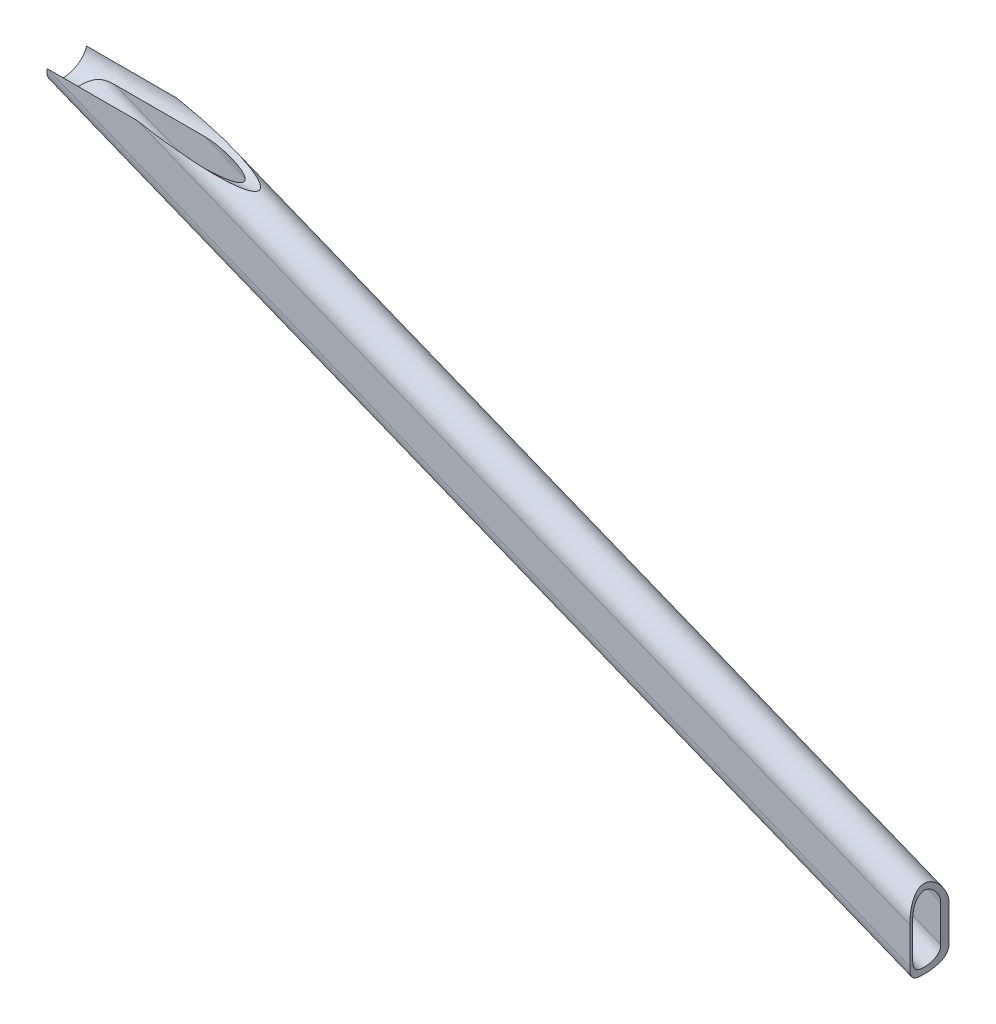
ISO-10303-21;
HEADER;
FILE_DESCRIPTION(('STEP AP214'),'2;1');
FILE_NAME('part.step','',(''),(''),'','','');
FILE_SCHEMA(('AUTOMOTIVE_DESIGN { 1 0 10303 214 1 1 1 1 }'));
ENDSEC;
DATA;
#1=APPLICATION_CONTEXT('core data for automotive mechanical design processes');
#2=APPLICATION_PROTOCOL_DEFINITION('international standard','automotive_design',2000,#1);
#3=PRODUCT_CONTEXT('',#1,'mechanical');
#4=PRODUCT('Part','Part','',(#3));
#5=PRODUCT_RELATED_PRODUCT_CATEGORY('part','',(#4));
#6=PRODUCT_DEFINITION_FORMATION('','',#4);
#7=PRODUCT_DEFINITION_CONTEXT('part definition',#1,'design');
#8=PRODUCT_DEFINITION('design','',#6,#7);
#9=PRODUCT_DEFINITION_SHAPE('','',#8);
#10=(LENGTH_UNIT() NAMED_UNIT(*) SI_UNIT(.MILLI.,.METRE.));
#11=(NAMED_UNIT(*) PLANE_ANGLE_UNIT() SI_UNIT($,.RADIAN.));
#12=(NAMED_UNIT(*) SI_UNIT($,.STERADIAN.) SOLID_ANGLE_UNIT());
#13=UNCERTAINTY_MEASURE_WITH_UNIT(LENGTH_MEASURE(1.E-05),#10,'distance_accuracy_value','');
#14=(GEOMETRIC_REPRESENTATION_CONTEXT(3) GLOBAL_UNCERTAINTY_ASSIGNED_CONTEXT((#13)) GLOBAL_UNIT_ASSIGNED_CONTEXT((#10,
#11,#12)) REPRESENTATION_CONTEXT('',''));
#15=CARTESIAN_POINT('',(0.,0.,0.));
#16=DIRECTION('',(0.,0.,1.));
#17=DIRECTION('',(1.,0.,0.));
#18=AXIS2_PLACEMENT_3D('',#15,#16,#17);
#19=CARTESIAN_POINT('',(-86.5689003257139,52.7721881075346,0.));
#20=DIRECTION('',(0.927951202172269,-0.372701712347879,0.));
#21=DIRECTION('',(0.372701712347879,0.927951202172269,0.));
#22=AXIS2_PLACEMENT_3D('',#19,#20,#21);
#23=CYLINDRICAL_SURFACE('',#22,7.);
#24=CARTESIAN_POINT('',(275.335644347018,-92.5829159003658,7.));
#25=CARTESIAN_POINT('',(275.335685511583,-92.7644697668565,7.00002012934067));
#26=CARTESIAN_POINT('',(275.332134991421,-92.9460706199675,6.99391888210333));
#27=CARTESIAN_POINT('',(275.317795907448,-93.3081864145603,6.96902299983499));
#28=CARTESIAN_POINT('',(275.307004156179,-93.4887008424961,6.95022277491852));
#29=CARTESIAN_POINT('',(275.278146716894,-93.8470669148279,6.89951072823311));
#30=CARTESIAN_POINT('',(275.260090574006,-94.0249217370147,6.86761611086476));
#31=CARTESIAN_POINT('',(275.216985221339,-94.3768193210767,6.79047513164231));
#32=CARTESIAN_POINT('',(275.191937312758,-94.5508627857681,6.74523125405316));
#33=CARTESIAN_POINT('',(275.135299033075,-94.8943344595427,6.64117886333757));
#34=CARTESIAN_POINT('',(275.103689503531,-95.0637474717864,6.58233056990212));
#35=CARTESIAN_POINT('',(275.034775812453,-95.3961398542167,6.45130049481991));
#36=CARTESIAN_POINT('',(274.997471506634,-95.5591190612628,6.37911837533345));
#37=CARTESIAN_POINT('',(274.918203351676,-95.8774043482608,6.22182302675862));
#38=CARTESIAN_POINT('',(274.876242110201,-96.0327146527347,6.13671702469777));
#39=CARTESIAN_POINT('',(274.788799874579,-96.3347845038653,5.95406854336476));
#40=CARTESIAN_POINT('',(274.743318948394,-96.4815442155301,5.85652630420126));
#41=CARTESIAN_POINT('',(274.651027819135,-96.7628052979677,5.65177646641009));
#42=CARTESIAN_POINT('',(274.604263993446,-96.8974963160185,5.54480805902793));
#43=CARTESIAN_POINT('',(274.509704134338,-97.1573656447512,5.3202146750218));
#44=CARTESIAN_POINT('',(274.46190776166,-97.2825407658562,5.20258615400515));
#45=CARTESIAN_POINT('',(274.366430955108,-97.5229104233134,4.95739472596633));
#46=CARTESIAN_POINT('',(274.31875058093,-97.6381005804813,4.82982750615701));
#47=CARTESIAN_POINT('',(274.224625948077,-97.8580696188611,4.56558277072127));
#48=CARTESIAN_POINT('',(274.178181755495,-97.962847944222,4.42890476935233));
#49=CARTESIAN_POINT('',(274.084604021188,-98.1681686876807,4.13806796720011));
#50=CARTESIAN_POINT('',(274.037622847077,-98.2679899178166,3.98335043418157));
#51=CARTESIAN_POINT('',(273.947385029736,-98.4551237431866,3.66558408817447));
#52=CARTESIAN_POINT('',(273.904126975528,-98.5424410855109,3.50253846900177));
#53=CARTESIAN_POINT('',(273.822309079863,-98.7043843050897,3.16904904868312));
#54=CARTESIAN_POINT('',(273.783751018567,-98.7790053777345,2.99860247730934));
#55=CARTESIAN_POINT('',(273.712245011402,-98.9152634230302,2.65153081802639));
#56=CARTESIAN_POINT('',(273.679295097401,-98.9769049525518,2.47490792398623));
#57=CARTESIAN_POINT('',(273.618613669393,-99.0891024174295,2.10986268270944));
#58=CARTESIAN_POINT('',(273.591123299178,-99.1391577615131,1.92124606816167));
#59=CARTESIAN_POINT('',(273.54361471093,-99.2249408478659,1.53985435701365));
#60=CARTESIAN_POINT('',(273.5235966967,-99.2606681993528,1.34707914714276));
#61=CARTESIAN_POINT('',(273.491507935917,-99.3176600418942,0.958742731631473));
#62=CARTESIAN_POINT('',(273.479437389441,-99.3389241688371,0.763181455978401));
#63=CARTESIAN_POINT('',(273.463530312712,-99.3669043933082,0.370689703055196));
#64=CARTESIAN_POINT('',(273.459693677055,-99.3736206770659,0.173759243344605));
#65=CARTESIAN_POINT('',(273.460342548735,-99.3724826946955,-0.218816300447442));
#66=CARTESIAN_POINT('',(273.464776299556,-99.3647190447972,-0.414461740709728));
#67=CARTESIAN_POINT('',(273.481760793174,-99.3348295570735,-0.804297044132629));
#68=CARTESIAN_POINT('',(273.494311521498,-99.3127037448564,-0.998486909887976));
#69=CARTESIAN_POINT('',(273.527236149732,-99.2541762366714,-1.38402387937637));
#70=CARTESIAN_POINT('',(273.547609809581,-99.217774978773,-1.5753710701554));
#71=CARTESIAN_POINT('',(273.595702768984,-99.1308317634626,-1.95388322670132));
#72=CARTESIAN_POINT('',(273.623422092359,-99.0802897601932,-2.1410481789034));
#73=CARTESIAN_POINT('',(273.685538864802,-98.9652691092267,-2.5098144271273));
#74=CARTESIAN_POINT('',(273.719933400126,-98.9007965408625,-2.69141811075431));
#75=CARTESIAN_POINT('',(273.794588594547,-98.7581182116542,-3.04790025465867));
#76=CARTESIAN_POINT('',(273.83484926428,-98.6799124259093,-3.22277870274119));
#77=CARTESIAN_POINT('',(273.920265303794,-98.5100089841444,-3.56463608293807));
#78=CARTESIAN_POINT('',(273.965421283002,-98.418309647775,-3.73161402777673));
#79=CARTESIAN_POINT('',(274.059521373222,-98.2216718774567,-4.0565751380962));
#80=CARTESIAN_POINT('',(274.108467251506,-98.1167272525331,-4.21455404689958));
#81=CARTESIAN_POINT('',(274.209250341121,-97.8931239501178,-4.52149610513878));
#82=CARTESIAN_POINT('',(274.261106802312,-97.7743665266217,-4.67038106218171));
#83=CARTESIAN_POINT('',(274.365921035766,-97.5242869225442,-4.9566441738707));
#84=CARTESIAN_POINT('',(274.418878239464,-97.3929711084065,-5.09402809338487));
#85=CARTESIAN_POINT('',(274.524374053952,-97.1183405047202,-5.35626274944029));
#86=CARTESIAN_POINT('',(274.57691286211,-96.9750317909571,-5.48111976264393));
#87=CARTESIAN_POINT('',(274.680014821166,-96.6770716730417,-5.7173943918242));
#88=CARTESIAN_POINT('',(274.730578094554,-96.522420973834,-5.8288128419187));
#89=CARTESIAN_POINT('',(274.826274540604,-96.2088130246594,-6.03334440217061));
#90=CARTESIAN_POINT('',(274.871541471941,-96.0502471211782,-6.1269948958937));
#91=CARTESIAN_POINT('',(274.957432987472,-95.7244868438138,-6.30041180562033));
#92=CARTESIAN_POINT('',(274.998057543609,-95.5572924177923,-6.38017813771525));
#93=CARTESIAN_POINT('',(275.07346597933,-95.2154673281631,-6.5253717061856));
#94=CARTESIAN_POINT('',(275.10824825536,-95.0408346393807,-6.59079500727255));
#95=CARTESIAN_POINT('',(275.170969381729,-94.6856029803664,-6.70701851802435));
#96=CARTESIAN_POINT('',(275.198909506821,-94.5050051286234,-6.75782145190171));
#97=CARTESIAN_POINT('',(275.241808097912,-94.1806303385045,-6.83500260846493));
#98=CARTESIAN_POINT('',(275.258273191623,-94.0377367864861,-6.86430536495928));
#99=CARTESIAN_POINT('',(275.286511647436,-93.7499955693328,-6.91426081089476));
#100=CARTESIAN_POINT('',(275.29828540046,-93.6051480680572,-6.93491422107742));
#101=CARTESIAN_POINT('',(275.317054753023,-93.3143597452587,-6.96772976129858));
#102=CARTESIAN_POINT('',(275.324055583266,-93.1684202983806,-6.9799011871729));
#103=CARTESIAN_POINT('',(275.333358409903,-92.8759525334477,-6.99603957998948));
#104=CARTESIAN_POINT('',(275.335660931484,-92.7294242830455,-7.00000746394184));
#105=CARTESIAN_POINT('',(275.335644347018,-92.5829159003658,-7.));
#106=B_SPLINE_CURVE_WITH_KNOTS('',3,(#24,#25,#26,#27,#28,#29,#30,#31,#32,#33,#34,#35,#36,#37,
#38,#39,#40,#41,#42,#43,#44,#45,#46,#47,#48,#49,#50,#51,#52,#53,#54,#55,#56,#57,#58,#59,#60,#61,
#62,#63,#64,#65,#66,#67,#68,#69,#70,#71,#72,#73,#74,#75,#76,#77,#78,#79,#80,#81,#82,#83,#84,#85,
#86,#87,#88,#89,#90,#91,#92,#93,#94,#95,#96,#97,#98,#99,#100,#101,#102,#103,#104,#105),
.UNSPECIFIED.,.F.,.F.,(4,2,2,2,2,2,2,2,2,2,2,2,2,2,2,2,2,2,2,2,2,2,2,2,2,2,2,2,2,2,2,2,2,2,2,2,
2,2,2,2,4),(0.,0.544592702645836,1.08942528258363,1.63354429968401,2.17756212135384,
2.7231912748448,3.2688342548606,3.81417322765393,4.35950167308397,4.89364852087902,
5.42797362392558,5.9625318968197,6.49711869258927,7.06654829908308,7.63576114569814,
8.20518892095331,8.77441644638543,9.36492467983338,9.95544901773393,10.5459882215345,
11.1365198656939,11.7233683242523,12.3102157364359,12.8970451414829,13.4838764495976,
14.0704521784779,14.6570289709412,15.2436788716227,15.8306040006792,16.4220179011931,
17.0131335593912,17.6039515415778,18.1947328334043,18.762903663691,19.331077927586,
19.8994078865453,20.4676318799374,20.9076824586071,21.3476963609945,21.7872272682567,
22.2267090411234),.UNSPECIFIED.);
#107=CARTESIAN_POINT('',(275.335644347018,-92.5829159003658,7.));
#108=VERTEX_POINT('',#107);
#109=CARTESIAN_POINT('',(275.335644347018,-92.5829159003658,-7.));
#110=VERTEX_POINT('',#109);
#111=EDGE_CURVE('E168',#108,#110,#106,.T.);
#112=ORIENTED_EDGE('',*,*,#111,.F.);
#113=DIRECTION('',(0.927951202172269,-0.372701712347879,0.));
#114=VECTOR('',#113,1.);
#115=CARTESIAN_POINT('',(-86.5689003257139,52.7721881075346,7.));
#116=LINE('',#115,#114);
#117=CARTESIAN_POINT('',(-32.360595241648,31.,7.));
#118=VERTEX_POINT('',#117);
#119=EDGE_CURVE('E141',#118,#108,#116,.T.);
#120=ORIENTED_EDGE('',*,*,#119,.F.);
#121=CARTESIAN_POINT('',(-32.360595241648,31.,0.));
#122=DIRECTION('',(0.981822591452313,-0.189800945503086,0.));
#123=DIRECTION('',(-0.189800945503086,-0.981822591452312,0.));
#124=AXIS2_PLACEMENT_3D('',#121,#122,#123);
#125=ELLIPSE('',#124,7.12959760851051,7.);
#126=CARTESIAN_POINT('',(-32.360595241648,31.,-7.));
#127=VERTEX_POINT('',#126);
#128=EDGE_CURVE('E116',#127,#118,#125,.F.);
#129=ORIENTED_EDGE('',*,*,#128,.F.);
#130=DIRECTION('',(0.927951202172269,-0.372701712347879,0.));
#131=VECTOR('',#130,1.);
#132=CARTESIAN_POINT('',(-86.5689003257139,52.7721881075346,-7.));
#133=LINE('',#132,#131);
#134=EDGE_CURVE('E129',#127,#110,#133,.T.);
#135=ORIENTED_EDGE('',*,*,#134,.T.);
#136=EDGE_LOOP('',(#112,#120,#129,#135));
#137=FACE_BOUND('',#136,.T.);
#138=ADVANCED_FACE('F28',(#137),#23,.T.);
#139=CARTESIAN_POINT('',(-82.0964797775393,63.9076025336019,-5.));
#140=DIRECTION('',(0.,0.,1.));
#141=DIRECTION('',(0.,-1.,0.));
#142=AXIS2_PLACEMENT_3D('',#139,#140,#141);
#143=PLANE('',#142);
#144=DIRECTION('',(0.,1.,0.));
#145=VECTOR('',#144,1.);
#146=CARTESIAN_POINT('',(274.383303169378,-104.996034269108,-5.));
#147=LINE('',#146,#145);
#148=CARTESIAN_POINT('',(274.383303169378,-79.2687037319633,-5.));
#149=VERTEX_POINT('',#148);
#150=CARTESIAN_POINT('',(274.383303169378,-92.2004182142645,-5.));
#151=VERTEX_POINT('',#150);
#152=EDGE_CURVE('E56',#149,#151,#147,.F.);
#153=ORIENTED_EDGE('',*,*,#152,.F.);
#154=DIRECTION('',(0.927951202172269,-0.372701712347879,0.));
#155=VECTOR('',#154,1.);
#156=CARTESIAN_POINT('',(-82.0964797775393,63.9076025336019,-5.));
#157=LINE('',#156,#155);
#158=CARTESIAN_POINT('',(12.034193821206,26.1010205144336,-5.));
#159=VERTEX_POINT('',#158);
#160=EDGE_CURVE('E118',#159,#149,#157,.T.);
#161=ORIENTED_EDGE('',*,*,#160,.F.);
#162=DIRECTION('',(1.,0.,0.));
#163=VECTOR('',#162,1.);
#164=CARTESIAN_POINT('',(-89.177812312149,26.1010205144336,-5.));
#165=LINE('',#164,#163);
#166=CARTESIAN_POINT('',(-20.1631361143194,26.1010205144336,-5.));
#167=VERTEX_POINT('',#166);
#168=EDGE_CURVE('E114',#167,#159,#165,.T.);
#169=ORIENTED_EDGE('',*,*,#168,.F.);
#170=DIRECTION('',(0.927951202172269,-0.372701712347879,0.));
#171=VECTOR('',#170,1.);
#172=CARTESIAN_POINT('',(-86.5689003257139,52.7721881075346,-5.));
#173=LINE('',#172,#171);
#174=EDGE_CURVE('E121',#167,#151,#173,.T.);
#175=ORIENTED_EDGE('',*,*,#174,.T.);
#176=EDGE_LOOP('',(#153,#161,#169,#175));
#177=FACE_BOUND('',#176,.T.);
#178=ADVANCED_FACE('F148',(#177),#143,.T.);
#179=CARTESIAN_POINT('',(-82.0964797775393,63.9076025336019,5.));
#180=DIRECTION('',(0.,0.,1.));
#181=DIRECTION('',(0.,-1.,0.));
#182=AXIS2_PLACEMENT_3D('',#179,#180,#181);
#183=PLANE('',#182);
#184=DIRECTION('',(0.927951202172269,-0.372701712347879,0.));
#185=VECTOR('',#184,1.);
#186=CARTESIAN_POINT('',(-82.0964797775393,63.9076025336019,5.));
#187=LINE('',#186,#185);
#188=CARTESIAN_POINT('',(12.034193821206,26.1010205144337,5.));
#189=VERTEX_POINT('',#188);
#190=CARTESIAN_POINT('',(274.383303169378,-79.2687037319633,5.));
#191=VERTEX_POINT('',#190);
#192=EDGE_CURVE('E109',#189,#191,#187,.T.);
#193=ORIENTED_EDGE('',*,*,#192,.T.);
#194=DIRECTION('',(0.,1.,0.));
#195=VECTOR('',#194,1.);
#196=CARTESIAN_POINT('',(274.383303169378,-104.996034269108,5.));
#197=LINE('',#196,#195);
#198=CARTESIAN_POINT('',(274.383303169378,-92.2004182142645,5.));
#199=VERTEX_POINT('',#198);
#200=EDGE_CURVE('E96',#191,#199,#197,.F.);
#201=ORIENTED_EDGE('',*,*,#200,.T.);
#202=DIRECTION('',(0.927951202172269,-0.372701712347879,0.));
#203=VECTOR('',#202,1.);
#204=CARTESIAN_POINT('',(-86.5689003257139,52.7721881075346,5.));
#205=LINE('',#204,#203);
#206=CARTESIAN_POINT('',(-20.1631361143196,26.1010205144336,5.));
#207=VERTEX_POINT('',#206);
#208=EDGE_CURVE('E107',#207,#199,#205,.T.);
#209=ORIENTED_EDGE('',*,*,#208,.F.);
#210=DIRECTION('',(1.,0.,0.));
#211=VECTOR('',#210,1.);
#212=CARTESIAN_POINT('',(-89.177812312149,26.1010205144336,5.));
#213=LINE('',#212,#211);
#214=EDGE_CURVE('E124',#207,#189,#213,.T.);
#215=ORIENTED_EDGE('',*,*,#214,.T.);
#216=EDGE_LOOP('',(#193,#201,#209,#215));
#217=FACE_BOUND('',#216,.T.);
#218=ADVANCED_FACE('F105',(#217),#183,.F.);
#219=CARTESIAN_POINT('',(-82.0964797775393,63.9076025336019,0.));
#220=DIRECTION('',(0.927951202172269,-0.372701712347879,0.));
#221=DIRECTION('',(0.372701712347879,0.927951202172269,0.));
#222=AXIS2_PLACEMENT_3D('',#219,#220,#221);
#223=CYLINDRICAL_SURFACE('',#222,7.);
#224=CARTESIAN_POINT('',(273.46,-71.3543687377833,0.));
#225=CARTESIAN_POINT('',(273.460000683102,-71.3543701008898,0.161802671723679));
#226=CARTESIAN_POINT('',(273.462813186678,-71.3615562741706,0.323620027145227));
#227=CARTESIAN_POINT('',(273.473973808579,-71.39013690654,0.645807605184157));
#228=CARTESIAN_POINT('',(273.48232262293,-71.4115331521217,0.806177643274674));
#229=CARTESIAN_POINT('',(273.504296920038,-71.4680628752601,1.12417368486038));
#230=CARTESIAN_POINT('',(273.517924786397,-71.5032025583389,1.28179841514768));
#231=CARTESIAN_POINT('',(273.550058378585,-71.5865001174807,1.59312040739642));
#232=CARTESIAN_POINT('',(273.568566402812,-71.6346641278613,1.74681578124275));
#233=CARTESIAN_POINT('',(273.609786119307,-71.7426655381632,2.04804872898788));
#234=CARTESIAN_POINT('',(273.632463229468,-71.8024071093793,2.19562553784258));
#235=CARTESIAN_POINT('',(273.681567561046,-71.9328461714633,2.48523592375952));
#236=CARTESIAN_POINT('',(273.707996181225,-72.003547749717,2.62726740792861));
#237=CARTESIAN_POINT('',(273.792039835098,-72.2306008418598,3.04420408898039));
#238=CARTESIAN_POINT('',(273.854428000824,-72.4019401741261,3.31005854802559));
#239=CARTESIAN_POINT('',(274.015743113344,-72.8573446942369,3.92315163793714));
#240=CARTESIAN_POINT('',(274.118902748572,-73.1583153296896,4.25671883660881));
#241=CARTESIAN_POINT('',(274.277077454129,-73.6468023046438,4.71559285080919));
#242=CARTESIAN_POINT('',(274.330446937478,-73.8160487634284,4.86180197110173));
#243=CARTESIAN_POINT('',(274.437048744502,-74.1655737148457,5.14052365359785));
#244=CARTESIAN_POINT('',(274.490281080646,-74.3458511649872,5.2730375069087));
#245=CARTESIAN_POINT('',(274.596391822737,-74.7199608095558,5.52692635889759));
#246=CARTESIAN_POINT('',(274.649239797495,-74.9139970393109,5.64801208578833));
#247=CARTESIAN_POINT('',(274.752092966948,-75.3110889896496,5.87577299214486));
#248=CARTESIAN_POINT('',(274.802098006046,-75.5141452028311,5.98244738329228));
#249=CARTESIAN_POINT('',(274.897889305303,-75.9282029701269,6.18106197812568));
#250=CARTESIAN_POINT('',(274.943677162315,-76.1392014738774,6.27300776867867));
#251=CARTESIAN_POINT('',(275.029672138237,-76.5682821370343,6.44173245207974));
#252=CARTESIAN_POINT('',(275.069879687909,-76.7863637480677,6.51851251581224));
#253=CARTESIAN_POINT('',(275.140782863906,-77.2134751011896,6.65147880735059));
#254=CARTESIAN_POINT('',(275.171941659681,-77.4221002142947,6.70871611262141));
#255=CARTESIAN_POINT('',(275.227040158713,-77.8437667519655,6.80866778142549));
#256=CARTESIAN_POINT('',(275.25097983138,-78.0568081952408,6.85138208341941));
#257=CARTESIAN_POINT('',(275.290500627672,-78.4859754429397,6.92133678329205));
#258=CARTESIAN_POINT('',(275.306090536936,-78.7020977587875,6.9485934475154));
#259=CARTESIAN_POINT('',(275.327943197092,-79.136259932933,6.98667987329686));
#260=CARTESIAN_POINT('',(275.334207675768,-79.3542994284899,6.99751267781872));
#261=CARTESIAN_POINT('',(275.336448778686,-79.7560444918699,7.00139239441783));
#262=CARTESIAN_POINT('',(275.333897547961,-79.9397189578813,6.99698432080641));
#263=CARTESIAN_POINT('',(275.32137935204,-80.3060391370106,6.97524574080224));
#264=CARTESIAN_POINT('',(275.311413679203,-80.4886850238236,6.95791748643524));
#265=CARTESIAN_POINT('',(275.284037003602,-80.8515746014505,6.90989778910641));
#266=CARTESIAN_POINT('',(275.266629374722,-81.0318193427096,6.8792124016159));
#267=CARTESIAN_POINT('',(275.224608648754,-81.3886027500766,6.8041931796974));
#268=CARTESIAN_POINT('',(275.199995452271,-81.5651413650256,6.75985915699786));
#269=CARTESIAN_POINT('',(275.144027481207,-81.9135130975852,6.65734439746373));
#270=CARTESIAN_POINT('',(275.112657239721,-82.085334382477,6.59913185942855));
#271=CARTESIAN_POINT('',(275.044014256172,-82.4225101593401,6.46905705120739));
#272=CARTESIAN_POINT('',(275.006741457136,-82.5878645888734,6.39719464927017));
#273=CARTESIAN_POINT('',(274.92730975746,-82.9109657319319,6.24014539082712));
#274=CARTESIAN_POINT('',(274.885149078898,-83.0687096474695,6.15495368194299));
#275=CARTESIAN_POINT('',(274.797141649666,-83.3755045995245,5.97179488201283));
#276=CARTESIAN_POINT('',(274.751294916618,-83.5245556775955,5.87382785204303));
#277=CARTESIAN_POINT('',(274.65871436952,-83.8084608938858,5.66915216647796));
#278=CARTESIAN_POINT('',(274.612057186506,-83.943618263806,5.56282864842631));
#279=CARTESIAN_POINT('',(274.517645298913,-84.2044594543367,5.33949010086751));
#280=CARTESIAN_POINT('',(274.469890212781,-84.3301399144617,5.22247131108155));
#281=CARTESIAN_POINT('',(274.374457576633,-84.5714874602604,4.9785267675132));
#282=CARTESIAN_POINT('',(274.326780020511,-84.6871553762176,4.85160183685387));
#283=CARTESIAN_POINT('',(274.232598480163,-84.9081165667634,4.58861183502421));
#284=CARTESIAN_POINT('',(274.186094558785,-85.0134092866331,4.45254627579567));
#285=CARTESIAN_POINT('',(274.092337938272,-85.2198120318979,4.16296136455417));
#286=CARTESIAN_POINT('',(274.045233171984,-85.3202049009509,4.00888239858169));
#287=CARTESIAN_POINT('',(273.95468178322,-85.5085218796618,3.69235264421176));
#288=CARTESIAN_POINT('',(273.911233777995,-85.596450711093,3.52990505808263));
#289=CARTESIAN_POINT('',(273.828966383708,-85.7596700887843,3.19753730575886));
#290=CARTESIAN_POINT('',(273.790149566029,-85.8349536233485,3.02761305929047));
#291=CARTESIAN_POINT('',(273.718070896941,-85.9725693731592,2.68153246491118));
#292=CARTESIAN_POINT('',(273.684807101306,-86.034906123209,2.50537832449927));
#293=CARTESIAN_POINT('',(273.623413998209,-86.1485938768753,2.14109487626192));
#294=CARTESIAN_POINT('',(273.595528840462,-86.1994353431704,1.95276506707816));
#295=CARTESIAN_POINT('',(273.547197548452,-86.2868021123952,1.57187260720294));
#296=CARTESIAN_POINT('',(273.526751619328,-86.3233270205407,1.37930983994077));
#297=CARTESIAN_POINT('',(273.493784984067,-86.381921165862,0.991331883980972));
#298=CARTESIAN_POINT('',(273.481264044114,-86.4039908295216,0.795916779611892));
#299=CARTESIAN_POINT('',(273.4644429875,-86.4335894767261,0.403638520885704));
#300=CARTESIAN_POINT('',(273.460142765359,-86.4411186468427,0.206775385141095));
#301=CARTESIAN_POINT('',(273.459865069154,-86.441605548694,-0.185796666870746));
#302=CARTESIAN_POINT('',(273.463837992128,-86.4346501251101,-0.381505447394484));
#303=CARTESIAN_POINT('',(273.47991362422,-86.4063705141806,-0.771545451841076));
#304=CARTESIAN_POINT('',(273.492016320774,-86.3850463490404,-0.965876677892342));
#305=CARTESIAN_POINT('',(273.524068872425,-86.3281112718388,-1.35178129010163));
#306=CARTESIAN_POINT('',(273.544018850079,-86.2925001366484,-1.5433546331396));
#307=CARTESIAN_POINT('',(273.591298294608,-86.2071237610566,-1.92239184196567));
#308=CARTESIAN_POINT('',(273.618627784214,-86.1573584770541,-2.1098556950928));
#309=CARTESIAN_POINT('',(273.68000118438,-86.0438882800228,-2.47924687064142));
#310=CARTESIAN_POINT('',(273.714040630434,-85.9801926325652,-2.66117778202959));
#311=CARTESIAN_POINT('',(273.788034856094,-85.8390569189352,-3.01838341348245));
#312=CARTESIAN_POINT('',(273.827989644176,-85.7616168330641,-3.19365812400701));
#313=CARTESIAN_POINT('',(273.912845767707,-85.5932435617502,-3.53635021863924));
#314=CARTESIAN_POINT('',(273.957747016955,-85.5023106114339,-3.70376773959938));
#315=CARTESIAN_POINT('',(274.051402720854,-85.3071939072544,-4.02967510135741));
#316=CARTESIAN_POINT('',(274.100158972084,-85.2030039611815,-4.18816071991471));
#317=CARTESIAN_POINT('',(274.200638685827,-84.9808918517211,-4.49619695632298));
#318=CARTESIAN_POINT('',(274.252382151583,-84.8628698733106,-4.64566913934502));
#319=CARTESIAN_POINT('',(274.357052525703,-84.6142372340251,-4.93316964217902));
#320=CARTESIAN_POINT('',(274.409978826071,-84.4836329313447,-5.07120367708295));
#321=CARTESIAN_POINT('',(274.51552287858,-84.2103352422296,-5.33485505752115));
#322=CARTESIAN_POINT('',(274.568140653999,-84.0676427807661,-5.46047335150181));
#323=CARTESIAN_POINT('',(274.671489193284,-83.7708622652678,-5.69831640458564));
#324=CARTESIAN_POINT('',(274.722220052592,-83.6167747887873,-5.81054184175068));
#325=CARTESIAN_POINT('',(274.818380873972,-83.3040395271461,-6.01680446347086));
#326=CARTESIAN_POINT('',(274.863937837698,-83.1457747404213,-6.11136302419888));
#327=CARTESIAN_POINT('',(274.95046784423,-82.8205356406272,-6.28658575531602));
#328=CARTESIAN_POINT('',(274.991441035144,-82.6535616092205,-6.36725037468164));
#329=CARTESIAN_POINT('',(275.067560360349,-82.3122243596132,-6.51416058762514));
#330=CARTESIAN_POINT('',(275.102709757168,-82.1378653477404,-6.58041426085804));
#331=CARTESIAN_POINT('',(275.166208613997,-81.7830777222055,-6.69829706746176));
#332=CARTESIAN_POINT('',(275.194558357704,-81.6026493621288,-6.74992681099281));
#333=CARTESIAN_POINT('',(275.2421867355,-81.2488604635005,-6.835736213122));
#334=CARTESIAN_POINT('',(275.261927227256,-81.0757791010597,-6.87081607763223));
#335=CARTESIAN_POINT('',(275.29450975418,-80.7268358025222,-6.92834321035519));
#336=CARTESIAN_POINT('',(275.307349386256,-80.5509729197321,-6.95078607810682));
#337=CARTESIAN_POINT('',(275.326041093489,-80.1977568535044,-6.98336613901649));
#338=CARTESIAN_POINT('',(275.331893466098,-80.020403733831,-6.99350385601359));
#339=CARTESIAN_POINT('',(275.336772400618,-79.6652991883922,-7.0019522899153));
#340=CARTESIAN_POINT('',(275.335796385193,-79.4875476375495,-7.00025854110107));
#341=CARTESIAN_POINT('',(275.322619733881,-78.9365266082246,-6.97743593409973));
#342=CARTESIAN_POINT('',(275.299211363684,-78.5641677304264,-6.93690584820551));
#343=CARTESIAN_POINT('',(275.228213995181,-77.8297477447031,-6.81090496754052));
#344=CARTESIAN_POINT('',(275.180616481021,-77.4676903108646,-6.72541834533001));
#345=CARTESIAN_POINT('',(275.089756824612,-76.9004926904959,-6.55608309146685));
#346=CARTESIAN_POINT('',(275.052347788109,-76.6904034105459,-6.48520103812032));
#347=CARTESIAN_POINT('',(274.972139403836,-76.2765144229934,-6.32937823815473));
#348=CARTESIAN_POINT('',(274.929339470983,-76.0727154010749,-6.24443596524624));
#349=CARTESIAN_POINT('',(274.839498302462,-75.6719165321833,-6.06080839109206));
#350=CARTESIAN_POINT('',(274.792449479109,-75.4749297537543,-5.96209832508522));
#351=CARTESIAN_POINT('',(274.695379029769,-75.0889855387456,-5.75134067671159));
#352=CARTESIAN_POINT('',(274.645357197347,-74.9000286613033,-5.63929216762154));
#353=CARTESIAN_POINT('',(274.534340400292,-74.4978084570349,-5.38057034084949));
#354=CARTESIAN_POINT('',(274.472991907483,-74.2862979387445,-5.23129568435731));
#355=CARTESIAN_POINT('',(274.349806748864,-73.877696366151,-4.91444638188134));
#356=CARTESIAN_POINT('',(274.287969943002,-73.6806096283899,-4.74686629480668));
#357=CARTESIAN_POINT('',(274.105039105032,-73.1151760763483,-4.21712930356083));
#358=CARTESIAN_POINT('',(273.986041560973,-72.770983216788,-3.82692322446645));
#359=CARTESIAN_POINT('',(273.812331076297,-72.285679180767,-3.13324905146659));
#360=CARTESIAN_POINT('',(273.750131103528,-72.1165640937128,-2.85117084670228));
#361=CARTESIAN_POINT('',(273.668070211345,-71.8968155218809,-2.40938487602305));
#362=CARTESIAN_POINT('',(273.642597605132,-71.8292400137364,-2.25907450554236));
#363=CARTESIAN_POINT('',(273.596001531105,-71.706415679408,-1.95281892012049));
#364=CARTESIAN_POINT('',(273.574877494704,-71.651165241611,-1.79687444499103));
#365=CARTESIAN_POINT('',(273.540666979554,-71.5621061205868,-1.50660073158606));
#366=CARTESIAN_POINT('',(273.52682830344,-71.5262604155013,-1.37298224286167));
#367=CARTESIAN_POINT('',(273.502874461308,-71.4643905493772,-1.10316802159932));
#368=CARTESIAN_POINT('',(273.492758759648,-71.4383649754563,-0.966972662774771));
#369=CARTESIAN_POINT('',(273.476475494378,-71.3965426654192,-0.692754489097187));
#370=CARTESIAN_POINT('',(273.470308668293,-71.3807478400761,-0.554731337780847));
#371=CARTESIAN_POINT('',(273.462071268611,-71.3596619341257,-0.277808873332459));
#372=CARTESIAN_POINT('',(273.459999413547,-71.3543675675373,-0.138909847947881));
#373=CARTESIAN_POINT('',(273.46,-71.3543687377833,0.));
#374=B_SPLINE_CURVE_WITH_KNOTS('',3,(#224,#225,#226,#227,#228,#229,#230,#231,#232,#233,#234,
#235,#236,#237,#238,#239,#240,#241,#242,#243,#244,#245,#246,#247,#248,#249,#250,#251,#252,#253,
#254,#255,#256,#257,#258,#259,#260,#261,#262,#263,#264,#265,#266,#267,#268,#269,#270,#271,#272,
#273,#274,#275,#276,#277,#278,#279,#280,#281,#282,#283,#284,#285,#286,#287,#288,#289,#290,#291,
#292,#293,#294,#295,#296,#297,#298,#299,#300,#301,#302,#303,#304,#305,#306,#307,#308,#309,#310,
#311,#312,#313,#314,#315,#316,#317,#318,#319,#320,#321,#322,#323,#324,#325,#326,#327,#328,#329,
#330,#331,#332,#333,#334,#335,#336,#337,#338,#339,#340,#341,#342,#343,#344,#345,#346,#347,#348,
#349,#350,#351,#352,#353,#354,#355,#356,#357,#358,#359,#360,#361,#362,#363,#364,#365,#366,#367,
#368,#369,#370,#371,#372,#373),.UNSPECIFIED.,.T.,.F.,(4,2,2,2,2,2,2,2,2,2,2,2,2,2,2,2,2,2,2,2,2,
2,2,2,2,2,2,2,2,2,2,2,2,2,2,2,2,2,2,2,2,2,2,2,2,2,2,2,2,2,2,2,2,2,2,2,2,2,2,2,2,2,2,2,2,2,2,2,2,
2,2,2,2,2,4),(0.,0.485251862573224,0.970564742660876,1.45609700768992,1.94185835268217,
2.42375863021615,2.90583906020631,3.8696584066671,5.2446942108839,5.93401709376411,
6.62327493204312,7.32687979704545,8.03052313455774,8.73389893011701,9.43722039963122,
10.0923174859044,10.7474173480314,11.4018265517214,12.0561144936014,12.6067846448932,
13.1573588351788,13.7076836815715,14.2580161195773,14.8096219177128,15.3612330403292,
15.9130454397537,16.4648552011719,16.9988204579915,17.5329741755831,18.0670835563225,
18.6012214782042,19.1700909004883,19.7387442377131,20.3077118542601,20.8764798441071,
21.4669356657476,22.0574077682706,22.6478624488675,23.2383095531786,23.8252267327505,
24.4121430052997,24.999068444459,25.5859956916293,26.1725337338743,26.7590726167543,
27.3456012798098,27.9324049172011,28.5237392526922,29.114776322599,29.7057682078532,
30.2967301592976,30.8657038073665,31.4346590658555,32.0032945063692,32.5719062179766,
33.1043949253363,33.6370689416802,34.1697202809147,34.7025726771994,35.8240076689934,
36.9458377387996,37.6198793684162,38.293994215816,38.9693376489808,39.6447280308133,
40.4417777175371,41.2390649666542,42.8276165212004,43.8279031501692,44.3276517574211,
44.8273349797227,45.2440430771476,45.6606911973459,46.0774171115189,46.4940125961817),.UNSPECIFIED.);
#375=CARTESIAN_POINT('',(275.335644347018,-79.6512014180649,-7.00000000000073));
#376=VERTEX_POINT('',#375);
#377=CARTESIAN_POINT('',(275.335644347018,-79.6512014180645,7.));
#378=VERTEX_POINT('',#377);
#379=EDGE_CURVE('E48',#376,#378,#374,.T.);
#380=ORIENTED_EDGE('',*,*,#379,.F.);
#381=DIRECTION('',(0.927951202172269,-0.372701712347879,0.));
#382=VECTOR('',#381,1.);
#383=CARTESIAN_POINT('',(-82.0964797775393,63.9076025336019,-7.));
#384=LINE('',#383,#382);
#385=CARTESIAN_POINT('',(-0.163265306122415,31.,-7.));
#386=VERTEX_POINT('',#385);
#387=EDGE_CURVE('E188',#386,#376,#384,.T.);
#388=ORIENTED_EDGE('',*,*,#387,.F.);
#389=CARTESIAN_POINT('',(-0.163265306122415,31.,0.));
#390=DIRECTION('',(-0.189800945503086,-0.981822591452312,0.));
#391=DIRECTION('',(0.981822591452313,-0.189800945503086,0.));
#392=AXIS2_PLACEMENT_3D('',#389,#390,#391);
#393=ELLIPSE('',#392,36.8807435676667,7.);
#394=CARTESIAN_POINT('',(-0.163265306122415,31.,7.));
#395=VERTEX_POINT('',#394);
#396=EDGE_CURVE('E41',#395,#386,#393,.F.);
#397=ORIENTED_EDGE('',*,*,#396,.F.);
#398=DIRECTION('',(0.927951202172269,-0.372701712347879,0.));
#399=VECTOR('',#398,1.);
#400=CARTESIAN_POINT('',(-82.0964797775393,63.9076025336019,7.));
#401=LINE('',#400,#399);
#402=EDGE_CURVE('E123',#395,#378,#401,.T.);
#403=ORIENTED_EDGE('',*,*,#402,.T.);
#404=EDGE_LOOP('',(#380,#388,#397,#403));
#405=FACE_BOUND('',#404,.T.);
#406=ADVANCED_FACE('F172',(#405),#223,.T.);
#407=CARTESIAN_POINT('',(-82.0964797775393,63.9076025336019,-7.));
#408=DIRECTION('',(0.,0.,1.));
#409=DIRECTION('',(0.,-1.,0.));
#410=AXIS2_PLACEMENT_3D('',#407,#408,#409);
#411=PLANE('',#410);
#412=ORIENTED_EDGE('',*,*,#387,.T.);
#413=DIRECTION('',(0.,1.,0.));
#414=VECTOR('',#413,1.);
#415=CARTESIAN_POINT('',(275.335644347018,-104.996034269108,-7.));
#416=LINE('',#415,#414);
#417=EDGE_CURVE('E132',#376,#110,#416,.F.);
#418=ORIENTED_EDGE('',*,*,#417,.T.);
#419=ORIENTED_EDGE('',*,*,#134,.F.);
#420=DIRECTION('',(1.,0.,0.));
#421=VECTOR('',#420,1.);
#422=CARTESIAN_POINT('',(-89.177812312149,31.,-7.));
#423=LINE('',#422,#421);
#424=EDGE_CURVE('E126',#127,#386,#423,.T.);
#425=ORIENTED_EDGE('',*,*,#424,.T.);
#426=EDGE_LOOP('',(#412,#418,#419,#425));
#427=FACE_BOUND('',#426,.T.);
#428=ADVANCED_FACE('F177',(#427),#411,.F.);
#429=CARTESIAN_POINT('',(-82.0964797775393,63.9076025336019,7.));
#430=DIRECTION('',(0.,0.,1.));
#431=DIRECTION('',(0.,-1.,0.));
#432=AXIS2_PLACEMENT_3D('',#429,#430,#431);
#433=PLANE('',#432);
#434=DIRECTION('',(0.,1.,0.));
#435=VECTOR('',#434,1.);
#436=CARTESIAN_POINT('',(275.335644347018,-104.996034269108,7.));
#437=LINE('',#436,#435);
#438=EDGE_CURVE('E156',#378,#108,#437,.F.);
#439=ORIENTED_EDGE('',*,*,#438,.F.);
#440=ORIENTED_EDGE('',*,*,#402,.F.);
#441=DIRECTION('',(1.,0.,0.));
#442=VECTOR('',#441,1.);
#443=CARTESIAN_POINT('',(-89.177812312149,31.,7.));
#444=LINE('',#443,#442);
#445=EDGE_CURVE('E135',#118,#395,#444,.T.);
#446=ORIENTED_EDGE('',*,*,#445,.F.);
#447=ORIENTED_EDGE('',*,*,#119,.T.);
#448=EDGE_LOOP('',(#439,#440,#446,#447));
#449=FACE_BOUND('',#448,.T.);
#450=ADVANCED_FACE('F146',(#449),#433,.T.);
#451=CARTESIAN_POINT('',(-82.0964797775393,63.9076025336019,0.));
#452=DIRECTION('',(0.927951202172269,-0.372701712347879,0.));
#453=DIRECTION('',(0.372701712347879,0.927951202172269,0.));
#454=AXIS2_PLACEMENT_3D('',#451,#452,#453);
#455=CYLINDRICAL_SURFACE('',#454,5.);
#456=ORIENTED_EDGE('',*,*,#160,.T.);
#457=CARTESIAN_POINT('',(273.46,-73.5096544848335,0.));
#458=CARTESIAN_POINT('',(273.46000062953,-73.5096559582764,0.120614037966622));
#459=CARTESIAN_POINT('',(273.461563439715,-73.5149943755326,0.241255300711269));
#460=CARTESIAN_POINT('',(273.46776816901,-73.5362519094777,0.481574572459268));
#461=CARTESIAN_POINT('',(273.472411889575,-73.552177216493,0.601251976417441));
#462=CARTESIAN_POINT('',(273.484646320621,-73.5943466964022,0.838847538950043));
#463=CARTESIAN_POINT('',(273.492242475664,-73.6206099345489,0.956762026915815));
#464=CARTESIAN_POINT('',(273.510158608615,-73.6829934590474,1.18978654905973));
#465=CARTESIAN_POINT('',(273.520479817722,-73.7191182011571,1.30489528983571));
#466=CARTESIAN_POINT('',(273.543477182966,-73.8003470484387,1.53074732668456));
#467=CARTESIAN_POINT('',(273.556136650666,-73.8453876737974,1.64151520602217));
#468=CARTESIAN_POINT('',(273.583534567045,-73.9439539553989,1.85896087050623));
#469=CARTESIAN_POINT('',(273.598273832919,-73.9974829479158,1.96563702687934));
#470=CARTESIAN_POINT('',(273.645078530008,-74.1697233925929,2.27867780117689));
#471=CARTESIAN_POINT('',(273.679756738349,-74.3001774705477,2.47829690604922));
#472=CARTESIAN_POINT('',(273.756687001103,-74.6005072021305,2.87469172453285));
#473=CARTESIAN_POINT('',(273.799344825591,-74.7729392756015,3.06942685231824));
#474=CARTESIAN_POINT('',(273.886114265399,-75.1429719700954,3.43286362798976));
#475=CARTESIAN_POINT('',(273.930226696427,-75.3405868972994,3.60155035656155));
#476=CARTESIAN_POINT('',(274.025771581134,-75.7998547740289,3.94455907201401));
#477=CARTESIAN_POINT('',(274.076806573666,-76.0662588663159,4.11268767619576));
#478=CARTESIAN_POINT('',(274.147532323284,-76.4829761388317,4.33407146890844));
#479=CARTESIAN_POINT('',(274.170152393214,-76.6248555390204,4.40277431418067));
#480=CARTESIAN_POINT('',(274.212860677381,-76.9136839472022,4.52965674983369));
#481=CARTESIAN_POINT('',(274.232948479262,-77.0606337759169,4.58783462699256));
#482=CARTESIAN_POINT('',(274.272165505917,-77.3762593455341,4.69945995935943));
#483=CARTESIAN_POINT('',(274.290906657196,-77.5454633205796,4.75155451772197));
#484=CARTESIAN_POINT('',(274.323711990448,-77.8879966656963,4.84151130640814));
#485=CARTESIAN_POINT('',(274.337778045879,-78.0613243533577,4.87937923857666));
#486=CARTESIAN_POINT('',(274.360558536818,-78.4109114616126,4.94021177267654));
#487=CARTESIAN_POINT('',(274.369273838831,-78.5871704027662,4.96317878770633));
#488=CARTESIAN_POINT('',(274.380797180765,-78.9412240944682,4.99346809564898));
#489=CARTESIAN_POINT('',(274.383605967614,-79.1190186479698,5.00079236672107));
#490=CARTESIAN_POINT('',(274.382970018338,-79.4628661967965,4.99912827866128));
#491=CARTESIAN_POINT('',(274.379923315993,-79.6289245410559,4.99117822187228));
#492=CARTESIAN_POINT('',(274.368247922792,-79.9594867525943,4.96047386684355));
#493=CARTESIAN_POINT('',(274.359619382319,-80.1239906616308,4.93771996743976));
#494=CARTESIAN_POINT('',(274.336924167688,-80.4496502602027,4.87708170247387));
#495=CARTESIAN_POINT('',(274.322862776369,-80.6108090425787,4.83921203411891));
#496=CARTESIAN_POINT('',(274.28969820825,-80.928219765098,4.74820954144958));
#497=CARTESIAN_POINT('',(274.270595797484,-81.0844724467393,4.69507903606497));
#498=CARTESIAN_POINT('',(274.230962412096,-81.3692053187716,4.58209814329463));
#499=CARTESIAN_POINT('',(274.210993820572,-81.4985390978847,4.52419155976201));
#500=CARTESIAN_POINT('',(274.168377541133,-81.7512527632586,4.39741320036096));
#501=CARTESIAN_POINT('',(274.145730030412,-81.8746330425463,4.32854214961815));
#502=CARTESIAN_POINT('',(274.098431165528,-82.1144509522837,4.18025471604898));
#503=CARTESIAN_POINT('',(274.073780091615,-82.2308895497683,4.10083980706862));
#504=CARTESIAN_POINT('',(274.023217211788,-82.4559757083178,3.93200068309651));
#505=CARTESIAN_POINT('',(273.99730541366,-82.5646233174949,3.84257652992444));
#506=CARTESIAN_POINT('',(273.946388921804,-82.7678529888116,3.65935385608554));
#507=CARTESIAN_POINT('',(273.92140855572,-82.8628747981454,3.5660354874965));
#508=CARTESIAN_POINT('',(273.871686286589,-83.0447295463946,3.37161660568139));
#509=CARTESIAN_POINT('',(273.846944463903,-83.1315598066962,3.27051356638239));
#510=CARTESIAN_POINT('',(273.798373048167,-83.2964988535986,3.06128674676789));
#511=CARTESIAN_POINT('',(273.774543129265,-83.3746107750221,2.95316551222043));
#512=CARTESIAN_POINT('',(273.72839715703,-83.5217885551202,2.7305688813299));
#513=CARTESIAN_POINT('',(273.706081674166,-83.5908510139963,2.61609111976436));
#514=CARTESIAN_POINT('',(273.663181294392,-83.7206713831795,2.37959632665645));
#515=CARTESIAN_POINT('',(273.64263236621,-83.7812677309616,2.25748406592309));
#516=CARTESIAN_POINT('',(273.604225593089,-83.8924786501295,2.00833468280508));
#517=CARTESIAN_POINT('',(273.58636874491,-83.9430895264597,1.88129575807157));
#518=CARTESIAN_POINT('',(273.553815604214,-84.0340675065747,1.62325020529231));
#519=CARTESIAN_POINT('',(273.539118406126,-84.0744375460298,1.4922447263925));
#520=CARTESIAN_POINT('',(273.513243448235,-84.1447943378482,1.22708316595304));
#521=CARTESIAN_POINT('',(273.502066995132,-84.1747772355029,1.09292593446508));
#522=CARTESIAN_POINT('',(273.48336704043,-84.2246218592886,0.820194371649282));
#523=CARTESIAN_POINT('',(273.475906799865,-84.2443085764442,0.68158368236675));
#524=CARTESIAN_POINT('',(273.465108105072,-84.2727241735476,0.403032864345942));
#525=CARTESIAN_POINT('',(273.461771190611,-84.2814489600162,0.263092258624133));
#526=CARTESIAN_POINT('',(273.459309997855,-84.2878889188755,-0.0170325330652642));
#527=CARTESIAN_POINT('',(273.460184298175,-84.2856078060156,-0.157216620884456));
#528=CARTESIAN_POINT('',(273.466120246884,-84.270052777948,-0.436933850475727));
#529=CARTESIAN_POINT('',(273.471183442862,-84.2567747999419,-0.576466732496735));
#530=CARTESIAN_POINT('',(273.485392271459,-84.2192201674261,-0.85423319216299));
#531=CARTESIAN_POINT('',(273.494548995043,-84.194913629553,-0.992462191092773));
#532=CARTESIAN_POINT('',(273.516703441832,-84.1354083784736,-1.2662563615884));
#533=CARTESIAN_POINT('',(273.529702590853,-84.1002056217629,-1.40182052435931));
#534=CARTESIAN_POINT('',(273.5739869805,-83.9784570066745,-1.80295586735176));
#535=CARTESIAN_POINT('',(273.610575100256,-83.8757314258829,-2.06326195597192));
#536=CARTESIAN_POINT('',(273.693961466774,-83.6293109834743,-2.56125735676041));
#537=CARTESIAN_POINT('',(273.740744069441,-83.485678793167,-2.79898052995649));
#538=CARTESIAN_POINT('',(273.839462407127,-83.1602108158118,-3.24549547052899));
#539=CARTESIAN_POINT('',(273.891397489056,-82.9783798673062,-3.45429089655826));
#540=CARTESIAN_POINT('',(273.993821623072,-82.5834895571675,-3.83409893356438));
#541=CARTESIAN_POINT('',(274.044320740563,-82.3708989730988,-4.00559600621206));
#542=CARTESIAN_POINT('',(274.13888878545,-81.9182997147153,-4.30969323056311));
#543=CARTESIAN_POINT('',(274.182959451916,-81.6782984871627,-4.44230391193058));
#544=CARTESIAN_POINT('',(274.258998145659,-81.1832761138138,-4.6633686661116));
#545=CARTESIAN_POINT('',(274.29120307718,-80.9286815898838,-4.75269976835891));
#546=CARTESIAN_POINT('',(274.34180690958,-80.4074332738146,-4.89064799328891));
#547=CARTESIAN_POINT('',(274.360203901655,-80.1407778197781,-4.93925948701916));
#548=CARTESIAN_POINT('',(274.382373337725,-79.5954344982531,-4.9976685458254));
#549=CARTESIAN_POINT('',(274.385736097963,-79.3166163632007,-5.00637895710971));
#550=CARTESIAN_POINT('',(274.377408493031,-78.7608197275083,-4.98456269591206));
#551=CARTESIAN_POINT('',(274.365712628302,-78.4838419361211,-4.95402168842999));
#552=CARTESIAN_POINT('',(274.327232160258,-77.9069752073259,-4.85116119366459));
#553=CARTESIAN_POINT('',(274.298918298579,-77.6079511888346,-4.77458475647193));
#554=CARTESIAN_POINT('',(274.229935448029,-77.0250503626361,-4.57995421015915));
#555=CARTESIAN_POINT('',(274.189254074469,-76.7411890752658,-4.46185850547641));
#556=CARTESIAN_POINT('',(274.094151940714,-76.1593540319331,-4.16902892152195));
#557=CARTESIAN_POINT('',(274.03863970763,-75.864213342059,-3.98898535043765));
#558=CARTESIAN_POINT('',(273.924196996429,-75.3094214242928,-3.58144047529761));
#559=CARTESIAN_POINT('',(273.865268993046,-75.049744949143,-3.35397322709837));
#560=CARTESIAN_POINT('',(273.763756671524,-74.6279889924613,-2.90747874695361));
#561=CARTESIAN_POINT('',(273.720379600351,-74.4569253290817,-2.69712365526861));
#562=CARTESIAN_POINT('',(273.640213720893,-74.150758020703,-2.25051253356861));
#563=CARTESIAN_POINT('',(273.603417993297,-74.0156165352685,-2.01428413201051));
#564=CARTESIAN_POINT('',(273.545332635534,-73.8064164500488,-1.55771753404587));
#565=CARTESIAN_POINT('',(273.522535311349,-73.7261914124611,-1.34043347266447));
#566=CARTESIAN_POINT('',(273.495797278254,-73.6329509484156,-1.00675355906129));
#567=CARTESIAN_POINT('',(273.488130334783,-73.6063960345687,-0.89431538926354));
#568=CARTESIAN_POINT('',(273.475461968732,-73.5626657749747,-0.667500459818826));
#569=CARTESIAN_POINT('',(273.47045917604,-73.5454856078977,-0.553124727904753));
#570=CARTESIAN_POINT('',(273.464581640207,-73.5253313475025,-0.36547557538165));
#571=CARTESIAN_POINT('',(273.462865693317,-73.5194574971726,-0.292525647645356));
#572=CARTESIAN_POINT('',(273.460574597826,-73.5116183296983,-0.146387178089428));
#573=CARTESIAN_POINT('',(273.459999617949,-73.5096535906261,-0.0731986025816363));
#574=CARTESIAN_POINT('',(273.46,-73.5096544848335,0.));
#575=B_SPLINE_CURVE_WITH_KNOTS('',3,(#457,#458,#459,#460,#461,#462,#463,#464,#465,#466,#467,
#468,#469,#470,#471,#472,#473,#474,#475,#476,#477,#478,#479,#480,#481,#482,#483,#484,#485,#486,
#487,#488,#489,#490,#491,#492,#493,#494,#495,#496,#497,#498,#499,#500,#501,#502,#503,#504,#505,
#506,#507,#508,#509,#510,#511,#512,#513,#514,#515,#516,#517,#518,#519,#520,#521,#522,#523,#524,
#525,#526,#527,#528,#529,#530,#531,#532,#533,#534,#535,#536,#537,#538,#539,#540,#541,#542,#543,
#544,#545,#546,#547,#548,#549,#550,#551,#552,#553,#554,#555,#556,#557,#558,#559,#560,#561,#562,
#563,#564,#565,#566,#567,#568,#569,#570,#571,#572,#573,#574),.UNSPECIFIED.,.T.,.F.,(4,2,2,2,2,2,
2,2,2,2,2,2,2,2,2,2,2,2,2,2,2,2,2,2,2,2,2,2,2,2,2,2,2,2,2,2,2,2,2,2,2,2,2,2,2,2,2,2,2,2,2,2,2,2,
2,2,2,2,4),(0.,0.361762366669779,0.723736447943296,1.08638123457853,1.44919014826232,
1.80950324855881,2.16995831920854,2.89009890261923,3.67810147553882,4.46655371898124,
5.41982585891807,5.89723540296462,6.37472258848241,6.90815487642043,7.44137314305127,
7.97450503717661,8.50756950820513,9.00567492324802,9.50376691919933,10.0013757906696,
10.4989090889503,10.9276748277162,11.3564122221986,11.785089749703,12.2137646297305,
12.6198090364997,13.0259857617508,13.4320159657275,13.838198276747,14.2513019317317,
14.6645581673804,15.0776958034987,15.4909865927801,15.9110909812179,16.3313522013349,
16.7514715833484,17.1717462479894,17.5931665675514,18.0147434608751,18.8570230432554,
19.6980190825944,20.5389086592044,21.3681198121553,22.197106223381,23.0085071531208,
23.8200202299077,24.6535173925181,25.4873190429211,26.4135734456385,27.340758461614,
28.3864437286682,29.4313806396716,30.2519829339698,31.071717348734,31.7666818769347,
32.1136825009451,32.4605044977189,32.6800194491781,32.8995668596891),.UNSPECIFIED.);
#576=EDGE_CURVE('E151',#149,#191,#575,.T.);
#577=ORIENTED_EDGE('',*,*,#576,.T.);
#578=ORIENTED_EDGE('',*,*,#192,.F.);
#579=CARTESIAN_POINT('',(30.6808602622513,24.,0.));
#580=CARTESIAN_POINT('',(30.6808624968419,23.999999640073,-0.0674091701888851));
#581=CARTESIAN_POINT('',(30.6747097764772,24.0009848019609,-0.134812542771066));
#582=CARTESIAN_POINT('',(30.6508902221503,24.0047973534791,-0.267514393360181));
#583=CARTESIAN_POINT('',(30.6332087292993,24.0076270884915,-0.332810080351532));
#584=CARTESIAN_POINT('',(30.5813348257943,24.0159242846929,-0.479138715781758));
#585=CARTESIAN_POINT('',(30.543757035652,24.0219321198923,-0.558920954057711));
#586=CARTESIAN_POINT('',(30.45673815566,24.0358301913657,-0.711515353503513));
#587=CARTESIAN_POINT('',(30.4072697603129,24.0437247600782,-0.784310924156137));
#588=CARTESIAN_POINT('',(30.3057556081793,24.0599057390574,-0.915974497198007));
#589=CARTESIAN_POINT('',(30.2545264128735,24.068063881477,-0.975502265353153));
#590=CARTESIAN_POINT('',(30.1472150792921,24.0851328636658,-1.08993706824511));
#591=CARTESIAN_POINT('',(30.0911287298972,24.0940443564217,-1.14484001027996));
#592=CARTESIAN_POINT('',(29.9752457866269,24.1124334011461,-1.25072759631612));
#593=CARTESIAN_POINT('',(29.9154406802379,24.121912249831,-1.30170260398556));
#594=CARTESIAN_POINT('',(29.7931230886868,24.1412727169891,-1.4001324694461));
#595=CARTESIAN_POINT('',(29.7306116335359,24.1511541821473,-1.4475886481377));
#596=CARTESIAN_POINT('',(29.5655827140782,24.177203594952,-1.56687595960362));
#597=CARTESIAN_POINT('',(29.4614236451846,24.1936087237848,-1.63638025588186));
#598=CARTESIAN_POINT('',(29.2493141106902,24.2269333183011,-1.76925061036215));
#599=CARTESIAN_POINT('',(29.1413615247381,24.2438530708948,-1.83261315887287));
#600=CARTESIAN_POINT('',(28.9225020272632,24.2780652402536,-1.9543795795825));
#601=CARTESIAN_POINT('',(28.811590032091,24.2953582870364,-2.01277408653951));
#602=CARTESIAN_POINT('',(28.587653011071,24.3301763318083,-2.12530225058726));
#603=CARTESIAN_POINT('',(28.4746276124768,24.3477013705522,-2.17943514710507));
#604=CARTESIAN_POINT('',(28.1318124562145,24.4006993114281,-2.33701262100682));
#605=CARTESIAN_POINT('',(27.8995265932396,24.4364005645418,-2.43496639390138));
#606=CARTESIAN_POINT('',(27.5480812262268,24.4900597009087,-2.57353612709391));
#607=CARTESIAN_POINT('',(27.4305007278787,24.5079532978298,-2.61830843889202));
#608=CARTESIAN_POINT('',(27.1944302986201,24.5437546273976,-2.70538692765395));
#609=CARTESIAN_POINT('',(27.075940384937,24.5616623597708,-2.74769315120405));
#610=CARTESIAN_POINT('',(26.7092914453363,24.6168733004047,-2.87480153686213));
#611=CARTESIAN_POINT('',(26.459855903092,24.6541505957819,-2.95593679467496));
#612=CARTESIAN_POINT('',(25.9585372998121,24.7284391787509,-3.11044262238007));
#613=CARTESIAN_POINT('',(25.7066538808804,24.7654504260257,-3.18381203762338));
#614=CARTESIAN_POINT('',(25.2008923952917,24.8390677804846,-3.32403177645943));
#615=CARTESIAN_POINT('',(24.9470134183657,24.875673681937,-3.39087891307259));
#616=CARTESIAN_POINT('',(24.437746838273,24.9483305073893,-3.51890588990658));
#617=CARTESIAN_POINT('',(24.1823591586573,24.9843814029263,-3.58008544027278));
#618=CARTESIAN_POINT('',(23.4130711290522,25.0916951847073,-3.75646015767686));
#619=CARTESIAN_POINT('',(22.8973003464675,25.1619357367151,-3.8641516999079));
#620=CARTESIAN_POINT('',(21.8623209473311,25.298674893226,-4.06317401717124));
#621=CARTESIAN_POINT('',(21.3431133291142,25.3651745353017,-4.15450934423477));
#622=CARTESIAN_POINT('',(20.3026294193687,25.4932222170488,-4.32279430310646));
#623=CARTESIAN_POINT('',(19.7813577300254,25.5547779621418,-4.39976657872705));
#624=CARTESIAN_POINT('',(18.7362847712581,25.6716495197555,-4.54059891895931));
#625=CARTESIAN_POINT('',(18.2124832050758,25.7269645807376,-4.60445740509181));
#626=CARTESIAN_POINT('',(17.163534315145,25.829390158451,-4.71918317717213));
#627=CARTESIAN_POINT('',(16.6383906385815,25.8765140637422,-4.77007172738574));
#628=CARTESIAN_POINT('',(15.5861704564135,25.960120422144,-4.8583238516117));
#629=CARTESIAN_POINT('',(15.0590942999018,25.9966047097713,-4.89568975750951));
#630=CARTESIAN_POINT('',(14.1706454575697,26.0459773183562,-4.94555024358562));
#631=CARTESIAN_POINT('',(13.8097193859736,26.0626793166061,-4.96217423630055));
#632=CARTESIAN_POINT('',(13.0871756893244,26.0878153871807,-4.98705917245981));
#633=CARTESIAN_POINT('',(12.725557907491,26.096247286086,-4.99531791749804));
#634=CARTESIAN_POINT('',(12.002249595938,26.1027815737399,-5.00172988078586));
#635=CARTESIAN_POINT('',(11.640559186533,26.1008889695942,-4.99988799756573));
#636=CARTESIAN_POINT('',(11.0985157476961,26.0882836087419,-4.98749053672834));
#637=CARTESIAN_POINT('',(10.917934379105,26.082455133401,-4.98175331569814));
#638=CARTESIAN_POINT('',(10.5570874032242,26.0671291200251,-4.96657868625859));
#639=CARTESIAN_POINT('',(10.3768217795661,26.057631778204,-4.95714147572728));
#640=CARTESIAN_POINT('',(9.95623339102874,26.0306289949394,-4.93009595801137));
#641=CARTESIAN_POINT('',(9.71611401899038,26.0115042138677,-4.91080665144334));
#642=CARTESIAN_POINT('',(9.23757098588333,25.9646857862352,-4.86279212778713));
#643=CARTESIAN_POINT('',(8.99914764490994,25.9369905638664,-4.83406517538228));
#644=CARTESIAN_POINT('',(8.52571599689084,25.8718011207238,-4.76485523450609));
#645=CARTESIAN_POINT('',(8.29070271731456,25.8343230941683,-4.72439166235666));
#646=CARTESIAN_POINT('',(7.82575979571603,25.7483603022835,-4.62865675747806));
#647=CARTESIAN_POINT('',(7.59582720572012,25.6998821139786,-4.57339426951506));
#648=CARTESIAN_POINT('',(7.22781670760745,25.6113860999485,-4.46828944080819));
#649=CARTESIAN_POINT('',(7.08729053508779,25.5748956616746,-4.4240343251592));
#650=CARTESIAN_POINT('',(6.81045343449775,25.4973332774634,-4.32718385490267));
#651=CARTESIAN_POINT('',(6.67414118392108,25.4562627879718,-4.27459114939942));
#652=CARTESIAN_POINT('',(6.40705808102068,25.3698648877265,-4.16013334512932));
#653=CARTESIAN_POINT('',(6.27628034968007,25.3245430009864,-4.09828021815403));
#654=CARTESIAN_POINT('',(6.02144183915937,25.2302054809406,-3.96436312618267));
#655=CARTESIAN_POINT('',(5.89737983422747,25.1811905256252,-3.89230103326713));
#656=CARTESIAN_POINT('',(5.6764035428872,25.0884353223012,-3.74959267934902));
#657=CARTESIAN_POINT('',(5.5783013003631,25.0450889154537,-3.68052927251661));
#658=CARTESIAN_POINT('',(5.38869698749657,24.957280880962,-3.53451539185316));
#659=CARTESIAN_POINT('',(5.29719362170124,24.9128194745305,-3.45756647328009));
#660=CARTESIAN_POINT('',(5.12151560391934,24.823721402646,-3.29577124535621));
#661=CARTESIAN_POINT('',(5.03734174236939,24.7790847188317,-3.21092408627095));
#662=CARTESIAN_POINT('',(4.87695950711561,24.6906998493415,-3.03356958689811));
#663=CARTESIAN_POINT('',(4.80075128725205,24.6469516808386,-2.94106209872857));
#664=CARTESIAN_POINT('',(4.65655664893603,24.5613156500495,-2.74854029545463));
#665=CARTESIAN_POINT('',(4.58859600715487,24.5194338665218,-2.64850395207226));
#666=CARTESIAN_POINT('',(4.46148344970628,24.4387577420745,-2.44180388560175));
#667=CARTESIAN_POINT('',(4.40233170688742,24.399963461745,-2.33514003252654));
#668=CARTESIAN_POINT('',(4.29299893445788,24.3264560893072,-2.11593422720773));
#669=CARTESIAN_POINT('',(4.24282005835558,24.2917439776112,-2.00339087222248));
#670=CARTESIAN_POINT('',(4.15151402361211,24.2272904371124,-1.77332289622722));
#671=CARTESIAN_POINT('',(4.11038654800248,24.1975488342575,-1.65579844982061));
#672=CARTESIAN_POINT('',(4.03920076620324,24.145254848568,-1.42333038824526));
#673=CARTESIAN_POINT('',(4.0086555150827,24.1223955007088,-1.30860439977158));
#674=CARTESIAN_POINT('',(3.95558043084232,24.0822371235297,-1.07631466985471));
#675=CARTESIAN_POINT('',(3.93305340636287,24.0649400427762,-0.958749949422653));
#676=CARTESIAN_POINT('',(3.89599139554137,24.0362808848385,-0.721708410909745));
#677=CARTESIAN_POINT('',(3.88145292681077,24.02491622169,-0.602232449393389));
#678=CARTESIAN_POINT('',(3.86031046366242,24.0083363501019,-0.362115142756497));
#679=CARTESIAN_POINT('',(3.85370925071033,24.0031232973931,-0.241473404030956));
#680=CARTESIAN_POINT('',(3.848415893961,23.9989457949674,0.000785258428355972));
#681=CARTESIAN_POINT('',(3.84976938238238,24.0000173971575,0.122403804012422));
#682=CARTESIAN_POINT('',(3.86049603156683,24.0084718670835,0.365066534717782));
#683=CARTESIAN_POINT('',(3.86986919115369,24.0158547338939,0.486110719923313));
#684=CARTESIAN_POINT('',(3.8966652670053,24.0367847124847,0.726792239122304));
#685=CARTESIAN_POINT('',(3.9140898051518,24.0503330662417,0.846429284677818));
#686=CARTESIAN_POINT('',(3.95702537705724,24.08331012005,1.08337607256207));
#687=CARTESIAN_POINT('',(3.9825335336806,24.1027367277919,1.20068662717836));
#688=CARTESIAN_POINT('',(4.0417509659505,24.1471119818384,1.43243690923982));
#689=CARTESIAN_POINT('',(4.07547816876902,24.1720726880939,1.54686974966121));
#690=CARTESIAN_POINT('',(4.15112314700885,24.2269377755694,1.77172688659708));
#691=CARTESIAN_POINT('',(4.19303795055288,24.2568403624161,1.88215262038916));
#692=CARTESIAN_POINT('',(4.28505127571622,24.320919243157,2.09823213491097));
#693=CARTESIAN_POINT('',(4.33514858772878,24.3550949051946,2.20388661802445));
#694=CARTESIAN_POINT('',(4.44345368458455,24.4269346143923,2.40970811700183));
#695=CARTESIAN_POINT('',(4.50166136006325,24.4645986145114,2.50987520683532));
#696=CARTESIAN_POINT('',(4.62544223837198,24.5421742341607,2.70319002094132));
#697=CARTESIAN_POINT('',(4.6909430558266,24.5820620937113,2.79639365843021));
#698=CARTESIAN_POINT('',(4.82946838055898,24.6634910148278,2.97630800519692));
#699=CARTESIAN_POINT('',(4.90249541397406,24.705032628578,3.0630165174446));
#700=CARTESIAN_POINT('',(5.05561957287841,24.7888107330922,3.22952240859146));
#701=CARTESIAN_POINT('',(5.13571432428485,24.8310469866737,3.30932209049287));
#702=CARTESIAN_POINT('',(5.30245579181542,24.9153480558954,3.46187909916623));
#703=CARTESIAN_POINT('',(5.38910492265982,24.957412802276,3.53463380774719));
#704=CARTESIAN_POINT('',(5.66358407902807,25.0846966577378,3.74659252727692));
#705=CARTESIAN_POINT('',(5.86116361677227,25.1683155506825,3.87433323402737));
#706=CARTESIAN_POINT('',(6.27512200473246,25.3258438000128,4.10160752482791));
#707=CARTESIAN_POINT('',(6.49150381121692,25.3997516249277,4.20113666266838));
#708=CARTESIAN_POINT('',(6.9095682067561,25.5270332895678,4.36531611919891));
#709=CARTESIAN_POINT('',(7.10975401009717,25.5818165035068,4.43275905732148));
#710=CARTESIAN_POINT('',(7.51705906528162,25.6818327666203,4.55227143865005));
#711=CARTESIAN_POINT('',(7.72418333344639,25.7270587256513,4.60432947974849));
#712=CARTESIAN_POINT('',(8.14373408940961,25.8085306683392,4.69599904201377));
#713=CARTESIAN_POINT('',(8.35617858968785,25.8447397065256,4.73555952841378));
#714=CARTESIAN_POINT('',(8.7838668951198,25.9087726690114,4.80432995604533));
#715=CARTESIAN_POINT('',(8.9991099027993,25.9365989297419,4.83354278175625));
#716=CARTESIAN_POINT('',(9.53518888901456,25.9964292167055,4.89560911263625));
#717=CARTESIAN_POINT('',(9.85708614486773,26.0240204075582,4.92347193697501));
#718=CARTESIAN_POINT('',(10.5026978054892,26.0659440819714,4.96547118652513));
#719=CARTESIAN_POINT('',(10.8264131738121,26.0802687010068,4.97959947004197));
#720=CARTESIAN_POINT('',(11.4750747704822,26.0981745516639,4.99722482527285));
#721=CARTESIAN_POINT('',(11.8000221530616,26.1017329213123,5.00069927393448));
#722=CARTESIAN_POINT('',(12.4497703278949,26.1000763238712,4.99907362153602));
#723=CARTESIAN_POINT('',(12.7745711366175,26.0948632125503,4.99397533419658));
#724=CARTESIAN_POINT('',(13.4249903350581,26.0772407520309,4.97660436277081));
#725=CARTESIAN_POINT('',(13.7506072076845,26.0648044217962,4.96430477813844));
#726=CARTESIAN_POINT('',(14.4012678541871,26.0339930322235,4.93348225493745));
#727=CARTESIAN_POINT('',(14.7263116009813,26.0156176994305,4.9149590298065));
#728=CARTESIAN_POINT('',(15.3753345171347,25.9739644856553,4.87235598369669));
#729=CARTESIAN_POINT('',(15.6993144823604,25.9506922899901,4.84828260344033));
#730=CARTESIAN_POINT('',(16.3465121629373,25.9000370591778,4.79496919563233));
#731=CARTESIAN_POINT('',(16.6697298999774,25.8726541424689,4.76572931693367));
#732=CARTESIAN_POINT('',(17.3833226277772,25.8082991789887,4.69563202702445));
#733=CARTESIAN_POINT('',(17.7735121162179,25.7705219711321,4.6536247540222));
#734=CARTESIAN_POINT('',(18.5526872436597,25.6908127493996,4.56247714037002));
#735=CARTESIAN_POINT('',(18.9416726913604,25.6488801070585,4.5133357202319));
#736=CARTESIAN_POINT('',(19.7171819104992,25.561716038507,4.40791780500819));
#737=CARTESIAN_POINT('',(20.1037095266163,25.5164941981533,4.35166171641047));
#738=CARTESIAN_POINT('',(20.875202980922,25.4232411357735,4.23149303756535));
#739=CARTESIAN_POINT('',(21.2601689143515,25.3752100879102,4.1675809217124));
#740=CARTESIAN_POINT('',(22.1754501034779,25.2579906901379,4.00535962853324));
#741=CARTESIAN_POINT('',(22.7049711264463,25.1877439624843,3.90325087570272));
#742=CARTESIAN_POINT('',(23.4960914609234,25.0798665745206,3.73582644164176));
#743=CARTESIAN_POINT('',(23.7593740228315,25.043474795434,3.67761577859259));
#744=CARTESIAN_POINT('',(24.2845994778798,24.9699919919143,3.55584961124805));
#745=CARTESIAN_POINT('',(24.5465424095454,24.932900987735,3.49229426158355));
#746=CARTESIAN_POINT('',(25.1685108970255,24.8438826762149,3.33367450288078));
#747=CARTESIAN_POINT('',(25.5278009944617,24.7916976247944,3.23584442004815));
#748=CARTESIAN_POINT('',(26.2418384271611,24.6866732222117,3.02584889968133));
#749=CARTESIAN_POINT('',(26.5965890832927,24.6338344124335,2.9136946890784));
#750=CARTESIAN_POINT('',(27.1924928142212,24.5441182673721,2.70740682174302));
#751=CARTESIAN_POINT('',(27.4353461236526,24.5072795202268,2.61818372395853));
#752=CARTESIAN_POINT('',(27.9169301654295,24.433735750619,2.42789575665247));
#753=CARTESIAN_POINT('',(28.1556539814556,24.3970310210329,2.32681288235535));
#754=CARTESIAN_POINT('',(28.5110830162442,24.3420547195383,2.16221516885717));
#755=CARTESIAN_POINT('',(28.6304227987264,24.323538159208,2.10447235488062));
#756=CARTESIAN_POINT('',(28.8666446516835,24.2867804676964,1.98410108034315));
#757=CARTESIAN_POINT('',(28.9835272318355,24.2685392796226,1.92147364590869));
#758=CARTESIAN_POINT('',(29.2137177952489,24.2325178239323,1.79047202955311));
#759=CARTESIAN_POINT('',(29.3270342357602,24.2147364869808,1.72211311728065));
#760=CARTESIAN_POINT('',(29.5490313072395,24.1798145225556,1.57815319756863));
#761=CARTESIAN_POINT('',(29.6577151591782,24.1626734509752,1.50255734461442));
#762=CARTESIAN_POINT('',(29.850426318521,24.1322115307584,1.35576678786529));
#763=CARTESIAN_POINT('',(29.9355077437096,24.1187360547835,1.28600259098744));
#764=CARTESIAN_POINT('',(30.0990710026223,24.0927866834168,1.13843442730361));
#765=CARTESIAN_POINT('',(30.1775367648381,24.080315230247,1.06061185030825));
#766=CARTESIAN_POINT('',(30.3251842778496,24.056814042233,0.894079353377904));
#767=CARTESIAN_POINT('',(30.3942104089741,24.0458085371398,0.805224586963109));
#768=CARTESIAN_POINT('',(30.514956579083,24.0265356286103,0.616184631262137));
#769=CARTESIAN_POINT('',(30.5667652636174,24.0182542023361,0.51606114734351));
#770=CARTESIAN_POINT('',(30.6295706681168,24.0082092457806,0.345239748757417));
#771=CARTESIAN_POINT('',(30.6485870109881,24.0051659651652,0.277604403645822));
#772=CARTESIAN_POINT('',(30.6742214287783,24.001063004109,0.139974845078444));
#773=CARTESIAN_POINT('',(30.6808579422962,24.0000003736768,0.0699842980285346));
#774=CARTESIAN_POINT('',(30.6808602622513,24.,0.));
#775=B_SPLINE_CURVE_WITH_KNOTS('',3,(#579,#580,#581,#582,#583,#584,#585,#586,#587,#588,#589,
#590,#591,#592,#593,#594,#595,#596,#597,#598,#599,#600,#601,#602,#603,#604,#605,#606,#607,#608,
#609,#610,#611,#612,#613,#614,#615,#616,#617,#618,#619,#620,#621,#622,#623,#624,#625,#626,#627,
#628,#629,#630,#631,#632,#633,#634,#635,#636,#637,#638,#639,#640,#641,#642,#643,#644,#645,#646,
#647,#648,#649,#650,#651,#652,#653,#654,#655,#656,#657,#658,#659,#660,#661,#662,#663,#664,#665,
#666,#667,#668,#669,#670,#671,#672,#673,#674,#675,#676,#677,#678,#679,#680,#681,#682,#683,#684,
#685,#686,#687,#688,#689,#690,#691,#692,#693,#694,#695,#696,#697,#698,#699,#700,#701,#702,#703,
#704,#705,#706,#707,#708,#709,#710,#711,#712,#713,#714,#715,#716,#717,#718,#719,#720,#721,#722,
#723,#724,#725,#726,#727,#728,#729,#730,#731,#732,#733,#734,#735,#736,#737,#738,#739,#740,#741,
#742,#743,#744,#745,#746,#747,#748,#749,#750,#751,#752,#753,#754,#755,#756,#757,#758,#759,#760,
#761,#762,#763,#764,#765,#766,#767,#768,#769,#770,#771,#772,#773,#774),.UNSPECIFIED.,.T.,.F.,(4,
2,2,2,2,2,2,2,2,2,2,2,2,2,2,2,2,2,2,2,2,2,2,2,2,2,2,2,2,2,2,2,2,2,2,2,2,2,2,2,2,2,2,2,2,2,2,2,2,
2,2,2,2,2,2,2,2,2,2,2,2,2,2,2,2,2,2,2,2,2,2,2,2,2,2,2,2,2,2,2,2,2,2,2,2,2,2,2,2,2,2,2,2,2,2,2,2,
4),(0.,0.201950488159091,0.404158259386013,0.667841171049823,0.932135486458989,1.16866770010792,
1.40540707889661,1.64270988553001,1.8799231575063,2.25849427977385,2.63728047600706,
3.01676559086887,3.39631827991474,4.1596904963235,4.54092407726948,4.92215045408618,
5.71678353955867,6.51153460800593,7.30667209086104,8.10185021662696,9.69614135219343,
11.2899880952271,12.881300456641,14.4728042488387,16.0616817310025,17.6502850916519,
18.7352138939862,19.8204277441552,20.9051153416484,21.4473524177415,21.9895604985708,
22.7142281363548,23.4390290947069,24.1626377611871,24.8858149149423,25.340861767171,
25.7957643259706,26.250083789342,26.7043200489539,27.0866255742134,27.4688558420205,
27.851127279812,28.2334060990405,28.6168504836,29.0003023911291,29.3838462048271,
29.7673765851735,30.1296629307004,30.4920760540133,30.8543310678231,31.2167129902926,
31.5811757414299,31.9456384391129,32.3101745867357,32.6745811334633,33.0397897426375,
33.4048660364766,33.7698884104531,34.1349058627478,34.4965783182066,34.8583725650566,
35.2200457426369,35.5818528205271,36.3278024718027,37.0738696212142,37.7275700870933,
38.3817538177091,39.038575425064,39.6952137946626,40.6672422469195,41.639846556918,
42.6145147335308,43.5889767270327,44.5671022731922,45.5452728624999,46.5223139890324,
47.499326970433,48.68200466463,49.864861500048,51.0443994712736,52.2238643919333,
53.8550072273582,54.6712192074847,55.4874075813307,56.6152139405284,57.7421417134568,
58.5259457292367,59.3109554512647,59.712457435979,60.1138753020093,60.5142557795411,
60.9143531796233,61.2465471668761,61.5795262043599,61.9174628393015,62.253631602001,
62.4636098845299,62.6732751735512),.UNSPECIFIED.);
#776=EDGE_CURVE('E137',#189,#159,#775,.T.);
#777=ORIENTED_EDGE('',*,*,#776,.T.);
#778=EDGE_LOOP('',(#456,#577,#578,#777));
#779=FACE_BOUND('',#778,.T.);
#780=ADVANCED_FACE('F142',(#779),#455,.F.);
#781=CARTESIAN_POINT('',(-86.5689003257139,52.7721881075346,0.));
#782=DIRECTION('',(0.927951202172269,-0.372701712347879,0.));
#783=DIRECTION('',(0.372701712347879,0.927951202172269,0.));
#784=AXIS2_PLACEMENT_3D('',#781,#782,#783);
#785=CYLINDRICAL_SURFACE('',#784,5.);
#786=ORIENTED_EDGE('',*,*,#208,.T.);
#787=CARTESIAN_POINT('',(273.46,-86.4413689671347,0.));
#788=CARTESIAN_POINT('',(273.46000062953,-86.4413704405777,0.120614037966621));
#789=CARTESIAN_POINT('',(273.461563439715,-86.4467088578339,0.24125530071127));
#790=CARTESIAN_POINT('',(273.46776816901,-86.4679663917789,0.481574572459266));
#791=CARTESIAN_POINT('',(273.472411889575,-86.4838916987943,0.601251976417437));
#792=CARTESIAN_POINT('',(273.484646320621,-86.5260611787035,0.838847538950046));
#793=CARTESIAN_POINT('',(273.492242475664,-86.5523244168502,0.956762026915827));
#794=CARTESIAN_POINT('',(273.510158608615,-86.6147079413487,1.18978654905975));
#795=CARTESIAN_POINT('',(273.520479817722,-86.6508326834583,1.30489528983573));
#796=CARTESIAN_POINT('',(273.543477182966,-86.7320615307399,1.53074732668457));
#797=CARTESIAN_POINT('',(273.556136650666,-86.7771021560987,1.64151520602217));
#798=CARTESIAN_POINT('',(273.583534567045,-86.8756684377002,1.85896087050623));
#799=CARTESIAN_POINT('',(273.598273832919,-86.9291974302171,1.96563702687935));
#800=CARTESIAN_POINT('',(273.645078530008,-87.1014378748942,2.27867780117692));
#801=CARTESIAN_POINT('',(273.679756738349,-87.2318919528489,2.47829690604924));
#802=CARTESIAN_POINT('',(273.756687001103,-87.5322216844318,2.87469172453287));
#803=CARTESIAN_POINT('',(273.799344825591,-87.7046537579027,3.06942685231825));
#804=CARTESIAN_POINT('',(273.886114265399,-88.0746864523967,3.43286362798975));
#805=CARTESIAN_POINT('',(273.930226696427,-88.2723013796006,3.60155035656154));
#806=CARTESIAN_POINT('',(274.025771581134,-88.7315692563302,3.94455907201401));
#807=CARTESIAN_POINT('',(274.076806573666,-88.9979733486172,4.11268767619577));
#808=CARTESIAN_POINT('',(274.147532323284,-89.414690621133,4.33407146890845));
#809=CARTESIAN_POINT('',(274.170152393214,-89.5565700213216,4.40277431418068));
#810=CARTESIAN_POINT('',(274.212860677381,-89.8453984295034,4.52965674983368));
#811=CARTESIAN_POINT('',(274.232948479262,-89.9923482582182,4.58783462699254));
#812=CARTESIAN_POINT('',(274.272165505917,-90.3079738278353,4.69945995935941));
#813=CARTESIAN_POINT('',(274.290906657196,-90.4771778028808,4.75155451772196));
#814=CARTESIAN_POINT('',(274.323711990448,-90.8197111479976,4.84151130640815));
#815=CARTESIAN_POINT('',(274.337778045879,-90.993038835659,4.87937923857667));
#816=CARTESIAN_POINT('',(274.360558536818,-91.3426259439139,4.94021177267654));
#817=CARTESIAN_POINT('',(274.369273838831,-91.5188848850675,4.96317878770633));
#818=CARTESIAN_POINT('',(274.380797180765,-91.8729385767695,4.99346809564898));
#819=CARTESIAN_POINT('',(274.383605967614,-92.0507331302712,5.00079236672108));
#820=CARTESIAN_POINT('',(274.382970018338,-92.3945806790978,4.99912827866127));
#821=CARTESIAN_POINT('',(274.379923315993,-92.5606390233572,4.99117822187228));
#822=CARTESIAN_POINT('',(274.368247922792,-92.8912012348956,4.96047386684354));
#823=CARTESIAN_POINT('',(274.359619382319,-93.0557051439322,4.93771996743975));
#824=CARTESIAN_POINT('',(274.336924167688,-93.3813647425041,4.87708170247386));
#825=CARTESIAN_POINT('',(274.322862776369,-93.5425235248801,4.8392120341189));
#826=CARTESIAN_POINT('',(274.28969820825,-93.8599342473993,4.74820954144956));
#827=CARTESIAN_POINT('',(274.270595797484,-94.0161869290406,4.69507903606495));
#828=CARTESIAN_POINT('',(274.230962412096,-94.3009198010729,4.58209814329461));
#829=CARTESIAN_POINT('',(274.210993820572,-94.430253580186,4.52419155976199));
#830=CARTESIAN_POINT('',(274.168377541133,-94.6829672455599,4.39741320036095));
#831=CARTESIAN_POINT('',(274.145730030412,-94.8063475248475,4.32854214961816));
#832=CARTESIAN_POINT('',(274.098431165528,-95.046165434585,4.18025471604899));
#833=CARTESIAN_POINT('',(274.073780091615,-95.1626040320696,4.10083980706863));
#834=CARTESIAN_POINT('',(274.023217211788,-95.387690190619,3.93200068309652));
#835=CARTESIAN_POINT('',(273.99730541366,-95.4963377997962,3.84257652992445));
#836=CARTESIAN_POINT('',(273.946388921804,-95.6995674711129,3.65935385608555));
#837=CARTESIAN_POINT('',(273.92140855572,-95.7945892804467,3.56603548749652));
#838=CARTESIAN_POINT('',(273.871686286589,-95.9764440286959,3.3716166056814));
#839=CARTESIAN_POINT('',(273.846944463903,-96.0632742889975,3.2705135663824));
#840=CARTESIAN_POINT('',(273.798373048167,-96.2282133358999,3.0612867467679));
#841=CARTESIAN_POINT('',(273.774543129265,-96.3063252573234,2.95316551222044));
#842=CARTESIAN_POINT('',(273.72839715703,-96.4535030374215,2.73056888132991));
#843=CARTESIAN_POINT('',(273.706081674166,-96.5225654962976,2.61609111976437));
#844=CARTESIAN_POINT('',(273.663181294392,-96.6523858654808,2.37959632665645));
#845=CARTESIAN_POINT('',(273.64263236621,-96.7129822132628,2.25748406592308));
#846=CARTESIAN_POINT('',(273.604225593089,-96.8241931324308,2.00833468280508));
#847=CARTESIAN_POINT('',(273.58636874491,-96.8748040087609,1.88129575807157));
#848=CARTESIAN_POINT('',(273.553815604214,-96.965781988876,1.62325020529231));
#849=CARTESIAN_POINT('',(273.539118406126,-97.006152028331,1.4922447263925));
#850=CARTESIAN_POINT('',(273.513243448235,-97.0765088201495,1.22708316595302));
#851=CARTESIAN_POINT('',(273.502066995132,-97.1064917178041,1.09292593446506));
#852=CARTESIAN_POINT('',(273.48336704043,-97.1563363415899,0.820194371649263));
#853=CARTESIAN_POINT('',(273.475906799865,-97.1760230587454,0.681583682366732));
#854=CARTESIAN_POINT('',(273.465108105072,-97.2044386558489,0.403032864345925));
#855=CARTESIAN_POINT('',(273.461771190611,-97.2131634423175,0.263092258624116));
#856=CARTESIAN_POINT('',(273.459309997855,-97.2196034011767,-0.0170325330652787));
#857=CARTESIAN_POINT('',(273.460184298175,-97.2173222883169,-0.157216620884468));
#858=CARTESIAN_POINT('',(273.466120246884,-97.2017672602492,-0.436933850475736));
#859=CARTESIAN_POINT('',(273.471183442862,-97.1884892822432,-0.576466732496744));
#860=CARTESIAN_POINT('',(273.485392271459,-97.1509346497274,-0.854233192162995));
#861=CARTESIAN_POINT('',(273.494548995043,-97.1266281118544,-0.992462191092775));
#862=CARTESIAN_POINT('',(273.516703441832,-97.0671228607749,-1.2662563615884));
#863=CARTESIAN_POINT('',(273.529702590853,-97.0319201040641,-1.4018205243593));
#864=CARTESIAN_POINT('',(273.5739869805,-96.9101714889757,-1.80295586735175));
#865=CARTESIAN_POINT('',(273.610575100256,-96.8074459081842,-2.06326195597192));
#866=CARTESIAN_POINT('',(273.693961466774,-96.5610254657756,-2.56125735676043));
#867=CARTESIAN_POINT('',(273.740744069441,-96.4173932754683,-2.79898052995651));
#868=CARTESIAN_POINT('',(273.839462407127,-96.0919252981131,-3.24549547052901));
#869=CARTESIAN_POINT('',(273.891397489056,-95.9100943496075,-3.45429089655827));
#870=CARTESIAN_POINT('',(273.993821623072,-95.5152040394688,-3.83409893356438));
#871=CARTESIAN_POINT('',(274.044320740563,-95.3026134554,-4.00559600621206));
#872=CARTESIAN_POINT('',(274.13888878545,-94.8500141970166,-4.30969323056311));
#873=CARTESIAN_POINT('',(274.182959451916,-94.610012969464,-4.44230391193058));
#874=CARTESIAN_POINT('',(274.258998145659,-94.114990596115,-4.6633686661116));
#875=CARTESIAN_POINT('',(274.29120307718,-93.860396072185,-4.75269976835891));
#876=CARTESIAN_POINT('',(274.34180690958,-93.3391477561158,-4.89064799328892));
#877=CARTESIAN_POINT('',(274.360203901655,-93.0724923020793,-4.93925948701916));
#878=CARTESIAN_POINT('',(274.382373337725,-92.5271489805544,-4.9976685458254));
#879=CARTESIAN_POINT('',(274.385736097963,-92.2483308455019,-5.00637895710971));
#880=CARTESIAN_POINT('',(274.377408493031,-91.6925342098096,-4.98456269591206));
#881=CARTESIAN_POINT('',(274.365712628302,-91.4155564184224,-4.95402168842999));
#882=CARTESIAN_POINT('',(274.327232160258,-90.8386896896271,-4.8511611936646));
#883=CARTESIAN_POINT('',(274.298918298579,-90.5396656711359,-4.77458475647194));
#884=CARTESIAN_POINT('',(274.229935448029,-89.9567648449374,-4.57995421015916));
#885=CARTESIAN_POINT('',(274.189254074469,-89.672903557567,-4.46185850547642));
#886=CARTESIAN_POINT('',(274.094151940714,-89.0910685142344,-4.16902892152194));
#887=CARTESIAN_POINT('',(274.03863970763,-88.7959278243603,-3.98898535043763));
#888=CARTESIAN_POINT('',(273.924196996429,-88.241135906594,-3.58144047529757));
#889=CARTESIAN_POINT('',(273.865268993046,-87.9814594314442,-3.35397322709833));
#890=CARTESIAN_POINT('',(273.763756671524,-87.5597034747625,-2.90747874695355));
#891=CARTESIAN_POINT('',(273.720379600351,-87.388639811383,-2.69712365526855));
#892=CARTESIAN_POINT('',(273.640213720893,-87.0824725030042,-2.25051253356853));
#893=CARTESIAN_POINT('',(273.603417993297,-86.9473310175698,-2.01428413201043));
#894=CARTESIAN_POINT('',(273.545332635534,-86.73813093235,-1.5577175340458));
#895=CARTESIAN_POINT('',(273.522535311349,-86.6579058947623,-1.3404334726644));
#896=CARTESIAN_POINT('',(273.495797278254,-86.5646654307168,-1.00675355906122));
#897=CARTESIAN_POINT('',(273.488130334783,-86.5381105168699,-0.894315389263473));
#898=CARTESIAN_POINT('',(273.475461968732,-86.494380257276,-0.667500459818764));
#899=CARTESIAN_POINT('',(273.47045917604,-86.4772000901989,-0.5531247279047));
#900=CARTESIAN_POINT('',(273.464581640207,-86.4570458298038,-0.365475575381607));
#901=CARTESIAN_POINT('',(273.462865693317,-86.4511719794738,-0.292525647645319));
#902=CARTESIAN_POINT('',(273.460574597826,-86.4433328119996,-0.146387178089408));
#903=CARTESIAN_POINT('',(273.459999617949,-86.4413680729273,-0.0731986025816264));
#904=CARTESIAN_POINT('',(273.46,-86.4413689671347,0.));
#905=B_SPLINE_CURVE_WITH_KNOTS('',3,(#787,#788,#789,#790,#791,#792,#793,#794,#795,#796,#797,
#798,#799,#800,#801,#802,#803,#804,#805,#806,#807,#808,#809,#810,#811,#812,#813,#814,#815,#816,
#817,#818,#819,#820,#821,#822,#823,#824,#825,#826,#827,#828,#829,#830,#831,#832,#833,#834,#835,
#836,#837,#838,#839,#840,#841,#842,#843,#844,#845,#846,#847,#848,#849,#850,#851,#852,#853,#854,
#855,#856,#857,#858,#859,#860,#861,#862,#863,#864,#865,#866,#867,#868,#869,#870,#871,#872,#873,
#874,#875,#876,#877,#878,#879,#880,#881,#882,#883,#884,#885,#886,#887,#888,#889,#890,#891,#892,
#893,#894,#895,#896,#897,#898,#899,#900,#901,#902,#903,#904),.UNSPECIFIED.,.T.,.F.,(4,2,2,2,2,2,
2,2,2,2,2,2,2,2,2,2,2,2,2,2,2,2,2,2,2,2,2,2,2,2,2,2,2,2,2,2,2,2,2,2,2,2,2,2,2,2,2,2,2,2,2,2,2,2,
2,2,2,2,4),(0.,0.361762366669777,0.723736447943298,1.08638123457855,1.44919014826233,
1.80950324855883,2.16995831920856,2.89009890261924,3.67810147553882,4.46655371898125,
5.41982585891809,5.89723540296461,6.37472258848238,6.90815487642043,7.44137314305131,
7.97450503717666,8.50756950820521,9.00567492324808,9.50376691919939,10.0013757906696,
10.4989090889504,10.9276748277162,11.3564122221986,11.785089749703,12.2137646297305,
12.6198090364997,13.0259857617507,13.4320159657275,13.838198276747,14.2513019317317,
14.6645581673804,15.0776958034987,15.4909865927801,15.9110909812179,16.3313522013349,
16.7514715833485,17.1717462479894,17.5931665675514,18.0147434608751,18.8570230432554,
19.6980190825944,20.5389086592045,21.3681198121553,22.197106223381,23.0085071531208,
23.8200202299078,24.6535173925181,25.4873190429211,26.4135734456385,27.340758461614,
28.3864437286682,29.4313806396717,30.2519829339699,31.0717173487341,31.7666818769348,
32.1136825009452,32.4605044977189,32.6800194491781,32.8995668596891),.UNSPECIFIED.);
#906=EDGE_CURVE('E11',#199,#151,#905,.T.);
#907=ORIENTED_EDGE('',*,*,#906,.T.);
#908=ORIENTED_EDGE('',*,*,#174,.F.);
#909=CARTESIAN_POINT('',(-1.51646967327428,24.,0.));
#910=CARTESIAN_POINT('',(-1.51646743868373,23.999999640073,-0.0674091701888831));
#911=CARTESIAN_POINT('',(-1.52262015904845,24.0009848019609,-0.134812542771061));
#912=CARTESIAN_POINT('',(-1.5464397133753,24.0047973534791,-0.267514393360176));
#913=CARTESIAN_POINT('',(-1.56412120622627,24.0076270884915,-0.33281008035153));
#914=CARTESIAN_POINT('',(-1.6159951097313,24.0159242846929,-0.479138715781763));
#915=CARTESIAN_POINT('',(-1.65357289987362,24.0219321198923,-0.558920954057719));
#916=CARTESIAN_POINT('',(-1.74059177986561,24.0358301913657,-0.711515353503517));
#917=CARTESIAN_POINT('',(-1.79006017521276,24.0437247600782,-0.784310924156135));
#918=CARTESIAN_POINT('',(-1.89157432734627,24.0599057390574,-0.915974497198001));
#919=CARTESIAN_POINT('',(-1.94280352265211,24.068063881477,-0.97550226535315));
#920=CARTESIAN_POINT('',(-2.05011485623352,24.0851328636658,-1.0899370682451));
#921=CARTESIAN_POINT('',(-2.1062012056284,24.0940443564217,-1.14484001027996));
#922=CARTESIAN_POINT('',(-2.22208414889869,24.1124334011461,-1.25072759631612));
#923=CARTESIAN_POINT('',(-2.28188925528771,24.121912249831,-1.30170260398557));
#924=CARTESIAN_POINT('',(-2.4042068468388,24.1412727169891,-1.4001324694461));
#925=CARTESIAN_POINT('',(-2.4667183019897,24.1511541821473,-1.4475886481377));
#926=CARTESIAN_POINT('',(-2.63174722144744,24.177203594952,-1.56687595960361));
#927=CARTESIAN_POINT('',(-2.73590629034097,24.1936087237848,-1.63638025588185));
#928=CARTESIAN_POINT('',(-2.94801582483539,24.2269333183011,-1.76925061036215));
#929=CARTESIAN_POINT('',(-3.05596841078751,24.2438530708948,-1.83261315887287));
#930=CARTESIAN_POINT('',(-3.27482790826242,24.2780652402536,-1.95437957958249));
#931=CARTESIAN_POINT('',(-3.38573990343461,24.2953582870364,-2.01277408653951));
#932=CARTESIAN_POINT('',(-3.60967692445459,24.3301763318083,-2.12530225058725));
#933=CARTESIAN_POINT('',(-3.72270232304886,24.3477013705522,-2.17943514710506));
#934=CARTESIAN_POINT('',(-4.0655174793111,24.4006993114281,-2.33701262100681));
#935=CARTESIAN_POINT('',(-4.29780334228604,24.4364005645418,-2.43496639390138));
#936=CARTESIAN_POINT('',(-4.64924870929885,24.4900597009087,-2.57353612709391));
#937=CARTESIAN_POINT('',(-4.7668292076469,24.5079532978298,-2.61830843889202));
#938=CARTESIAN_POINT('',(-5.0028996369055,24.5437546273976,-2.70538692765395));
#939=CARTESIAN_POINT('',(-5.12138955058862,24.5616623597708,-2.74769315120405));
#940=CARTESIAN_POINT('',(-5.48803849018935,24.6168733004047,-2.87480153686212));
#941=CARTESIAN_POINT('',(-5.73747403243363,24.6541505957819,-2.95593679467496));
#942=CARTESIAN_POINT('',(-6.23879263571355,24.7284391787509,-3.11044262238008));
#943=CARTESIAN_POINT('',(-6.49067605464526,24.7654504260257,-3.18381203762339));
#944=CARTESIAN_POINT('',(-6.99643754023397,24.8390677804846,-3.32403177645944));
#945=CARTESIAN_POINT('',(-7.25031651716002,24.875673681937,-3.3908789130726));
#946=CARTESIAN_POINT('',(-7.75958309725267,24.9483305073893,-3.5189058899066));
#947=CARTESIAN_POINT('',(-8.01497077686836,24.9843814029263,-3.5800854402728));
#948=CARTESIAN_POINT('',(-8.78425880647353,25.0916951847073,-3.75646015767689));
#949=CARTESIAN_POINT('',(-9.30002958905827,25.1619357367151,-3.86415169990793));
#950=CARTESIAN_POINT('',(-10.3350089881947,25.2986748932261,-4.06317401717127));
#951=CARTESIAN_POINT('',(-10.8542166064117,25.3651745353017,-4.1545093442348));
#952=CARTESIAN_POINT('',(-11.8947005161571,25.4932222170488,-4.32279430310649));
#953=CARTESIAN_POINT('',(-12.4159722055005,25.5547779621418,-4.39976657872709));
#954=CARTESIAN_POINT('',(-13.4610451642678,25.6716495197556,-4.54059891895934));
#955=CARTESIAN_POINT('',(-13.9848467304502,25.7269645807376,-4.60445740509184));
#956=CARTESIAN_POINT('',(-15.0337956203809,25.829390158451,-4.71918317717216));
#957=CARTESIAN_POINT('',(-15.5589392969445,25.8765140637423,-4.77007172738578));
#958=CARTESIAN_POINT('',(-16.6111594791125,25.9601204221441,-4.85832385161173));
#959=CARTESIAN_POINT('',(-17.1382356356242,25.9966047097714,-4.89568975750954));
#960=CARTESIAN_POINT('',(-18.0266844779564,26.0459773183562,-4.94555024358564));
#961=CARTESIAN_POINT('',(-18.3876105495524,26.0626793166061,-4.96217423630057));
#962=CARTESIAN_POINT('',(-19.1101542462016,26.0878153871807,-4.98705917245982));
#963=CARTESIAN_POINT('',(-19.471772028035,26.096247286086,-4.99531791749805));
#964=CARTESIAN_POINT('',(-20.195080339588,26.1027815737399,-5.00172988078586));
#965=CARTESIAN_POINT('',(-20.556770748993,26.1008889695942,-4.99988799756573));
#966=CARTESIAN_POINT('',(-21.0988141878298,26.0882836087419,-4.98749053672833));
#967=CARTESIAN_POINT('',(-21.279395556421,26.082455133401,-4.98175331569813));
#968=CARTESIAN_POINT('',(-21.6402425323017,26.0671291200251,-4.96657868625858));
#969=CARTESIAN_POINT('',(-21.8205081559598,26.057631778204,-4.95714147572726));
#970=CARTESIAN_POINT('',(-22.2410965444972,26.0306289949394,-4.93009595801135));
#971=CARTESIAN_POINT('',(-22.4812159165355,26.0115042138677,-4.91080665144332));
#972=CARTESIAN_POINT('',(-22.9597589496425,25.9646857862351,-4.8627921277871));
#973=CARTESIAN_POINT('',(-23.1981822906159,25.9369905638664,-4.83406517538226));
#974=CARTESIAN_POINT('',(-23.671613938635,25.8718011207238,-4.76485523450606));
#975=CARTESIAN_POINT('',(-23.9066272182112,25.8343230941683,-4.72439166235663));
#976=CARTESIAN_POINT('',(-24.3715701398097,25.7483603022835,-4.62865675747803));
#977=CARTESIAN_POINT('',(-24.6015027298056,25.6998821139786,-4.57339426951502));
#978=CARTESIAN_POINT('',(-24.9695132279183,25.6113860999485,-4.46828944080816));
#979=CARTESIAN_POINT('',(-25.1100394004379,25.5748956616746,-4.42403432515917));
#980=CARTESIAN_POINT('',(-25.386876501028,25.4973332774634,-4.32718385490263));
#981=CARTESIAN_POINT('',(-25.5231887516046,25.4562627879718,-4.27459114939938));
#982=CARTESIAN_POINT('',(-25.790271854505,25.3698648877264,-4.16013334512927));
#983=CARTESIAN_POINT('',(-25.9210495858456,25.3245430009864,-4.09828021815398));
#984=CARTESIAN_POINT('',(-26.1758880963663,25.2302054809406,-3.96436312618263));
#985=CARTESIAN_POINT('',(-26.2999501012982,25.1811905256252,-3.89230103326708));
#986=CARTESIAN_POINT('',(-26.5209263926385,25.0884353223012,-3.74959267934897));
#987=CARTESIAN_POINT('',(-26.6190286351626,25.0450889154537,-3.68052927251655));
#988=CARTESIAN_POINT('',(-26.8086329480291,24.9572808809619,-3.5345153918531));
#989=CARTESIAN_POINT('',(-26.9001363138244,24.9128194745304,-3.45756647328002));
#990=CARTESIAN_POINT('',(-27.0758143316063,24.823721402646,-3.29577124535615));
#991=CARTESIAN_POINT('',(-27.1599881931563,24.7790847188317,-3.21092408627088));
#992=CARTESIAN_POINT('',(-27.3203704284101,24.6906998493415,-3.03356958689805));
#993=CARTESIAN_POINT('',(-27.3965786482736,24.6469516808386,-2.94106209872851));
#994=CARTESIAN_POINT('',(-27.5407732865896,24.5613156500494,-2.74854029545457));
#995=CARTESIAN_POINT('',(-27.6087339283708,24.5194338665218,-2.6485039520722));
#996=CARTESIAN_POINT('',(-27.7358464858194,24.4387577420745,-2.44180388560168));
#997=CARTESIAN_POINT('',(-27.7949982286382,24.3999634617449,-2.33514003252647));
#998=CARTESIAN_POINT('',(-27.9043310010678,24.3264560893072,-2.11593422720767));
#999=CARTESIAN_POINT('',(-27.9545098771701,24.2917439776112,-2.00339087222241));
#1000=CARTESIAN_POINT('',(-28.0458159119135,24.2272904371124,-1.77332289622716));
#1001=CARTESIAN_POINT('',(-28.0869433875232,24.1975488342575,-1.65579844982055));
#1002=CARTESIAN_POINT('',(-28.1581291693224,24.145254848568,-1.42333038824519));
#1003=CARTESIAN_POINT('',(-28.1886744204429,24.1223955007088,-1.30860439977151));
#1004=CARTESIAN_POINT('',(-28.2417495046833,24.0822371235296,-1.07631466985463));
#1005=CARTESIAN_POINT('',(-28.2642765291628,24.0649400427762,-0.958749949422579));
#1006=CARTESIAN_POINT('',(-28.3013385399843,24.0362808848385,-0.721708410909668));
#1007=CARTESIAN_POINT('',(-28.3158770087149,24.02491622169,-0.60223244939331));
#1008=CARTESIAN_POINT('',(-28.3370194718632,24.0083363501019,-0.362115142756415));
#1009=CARTESIAN_POINT('',(-28.3436206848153,24.0031232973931,-0.241473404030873));
#1010=CARTESIAN_POINT('',(-28.3489140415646,23.9989457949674,0.000785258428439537));
#1011=CARTESIAN_POINT('',(-28.3475605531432,24.0000173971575,0.122403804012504));
#1012=CARTESIAN_POINT('',(-28.3368339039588,24.0084718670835,0.365066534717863));
#1013=CARTESIAN_POINT('',(-28.3274607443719,24.0158547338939,0.486110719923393));
#1014=CARTESIAN_POINT('',(-28.3006646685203,24.0367847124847,0.726792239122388));
#1015=CARTESIAN_POINT('',(-28.2832401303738,24.0503330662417,0.846429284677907));
#1016=CARTESIAN_POINT('',(-28.2403045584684,24.08331012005,1.08337607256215));
#1017=CARTESIAN_POINT('',(-28.214796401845,24.1027367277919,1.20068662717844));
#1018=CARTESIAN_POINT('',(-28.1555789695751,24.1471119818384,1.4324369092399));
#1019=CARTESIAN_POINT('',(-28.1218517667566,24.1720726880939,1.54686974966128));
#1020=CARTESIAN_POINT('',(-28.0462067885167,24.2269377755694,1.77172688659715));
#1021=CARTESIAN_POINT('',(-28.0042919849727,24.2568403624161,1.88215262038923));
#1022=CARTESIAN_POINT('',(-27.9122786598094,24.320919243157,2.09823213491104));
#1023=CARTESIAN_POINT('',(-27.8621813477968,24.3550949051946,2.20388661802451));
#1024=CARTESIAN_POINT('',(-27.753876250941,24.4269346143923,2.40970811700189));
#1025=CARTESIAN_POINT('',(-27.6956685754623,24.4645986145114,2.50987520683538));
#1026=CARTESIAN_POINT('',(-27.5718876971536,24.5421742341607,2.70319002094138));
#1027=CARTESIAN_POINT('',(-27.506386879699,24.5820620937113,2.79639365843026));
#1028=CARTESIAN_POINT('',(-27.3678615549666,24.6634910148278,2.97630800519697));
#1029=CARTESIAN_POINT('',(-27.2948345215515,24.705032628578,3.06301651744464));
#1030=CARTESIAN_POINT('',(-27.1417103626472,24.7888107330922,3.22952240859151));
#1031=CARTESIAN_POINT('',(-27.0616156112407,24.8310469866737,3.30932209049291));
#1032=CARTESIAN_POINT('',(-26.8948741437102,24.9153480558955,3.46187909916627));
#1033=CARTESIAN_POINT('',(-26.8082250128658,24.957412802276,3.53463380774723));
#1034=CARTESIAN_POINT('',(-26.5337458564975,25.0846966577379,3.74659252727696));
#1035=CARTESIAN_POINT('',(-26.3361663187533,25.1683155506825,3.8743332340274));
#1036=CARTESIAN_POINT('',(-25.9222079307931,25.3258438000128,4.10160752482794));
#1037=CARTESIAN_POINT('',(-25.7058261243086,25.3997516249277,4.20113666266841));
#1038=CARTESIAN_POINT('',(-25.2877617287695,25.5270332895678,4.36531611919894));
#1039=CARTESIAN_POINT('',(-25.0875759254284,25.5818165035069,4.43275905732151));
#1040=CARTESIAN_POINT('',(-24.6802708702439,25.6818327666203,4.55227143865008));
#1041=CARTESIAN_POINT('',(-24.4731466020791,25.7270587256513,4.60432947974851));
#1042=CARTESIAN_POINT('',(-24.0535958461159,25.8085306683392,4.69599904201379));
#1043=CARTESIAN_POINT('',(-23.8411513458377,25.8447397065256,4.7355595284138));
#1044=CARTESIAN_POINT('',(-23.4134630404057,25.9087726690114,4.80432995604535));
#1045=CARTESIAN_POINT('',(-23.1982200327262,25.9365989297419,4.83354278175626));
#1046=CARTESIAN_POINT('',(-22.6621410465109,25.9964292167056,4.89560911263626));
#1047=CARTESIAN_POINT('',(-22.3402437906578,26.0240204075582,4.92347193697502));
#1048=CARTESIAN_POINT('',(-21.6946321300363,26.0659440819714,4.96547118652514));
#1049=CARTESIAN_POINT('',(-21.3709167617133,26.0802687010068,4.97959947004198));
#1050=CARTESIAN_POINT('',(-20.7222551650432,26.0981745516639,4.99722482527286));
#1051=CARTESIAN_POINT('',(-20.3973077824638,26.1017329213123,5.00069927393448));
#1052=CARTESIAN_POINT('',(-19.7475596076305,26.1000763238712,4.99907362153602));
#1053=CARTESIAN_POINT('',(-19.4227587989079,26.0948632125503,4.99397533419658));
#1054=CARTESIAN_POINT('',(-18.7723396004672,26.0772407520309,4.9766043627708));
#1055=CARTESIAN_POINT('',(-18.4467227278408,26.0648044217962,4.96430477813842));
#1056=CARTESIAN_POINT('',(-17.7960620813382,26.0339930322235,4.93348225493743));
#1057=CARTESIAN_POINT('',(-17.471018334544,26.0156176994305,4.91495902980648));
#1058=CARTESIAN_POINT('',(-16.8219954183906,25.9739644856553,4.87235598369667));
#1059=CARTESIAN_POINT('',(-16.4980154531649,25.9506922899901,4.8482826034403));
#1060=CARTESIAN_POINT('',(-15.8508177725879,25.9000370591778,4.7949691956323));
#1061=CARTESIAN_POINT('',(-15.5276000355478,25.8726541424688,4.76572931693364));
#1062=CARTESIAN_POINT('',(-14.814007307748,25.8082991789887,4.69563202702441));
#1063=CARTESIAN_POINT('',(-14.4238178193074,25.7705219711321,4.65362475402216));
#1064=CARTESIAN_POINT('',(-13.6446426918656,25.6908127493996,4.56247714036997));
#1065=CARTESIAN_POINT('',(-13.2556572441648,25.6488801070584,4.51333572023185));
#1066=CARTESIAN_POINT('',(-12.4801480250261,25.561716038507,4.40791780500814));
#1067=CARTESIAN_POINT('',(-12.093620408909,25.5164941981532,4.35166171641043));
#1068=CARTESIAN_POINT('',(-11.3221269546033,25.4232411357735,4.2314930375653));
#1069=CARTESIAN_POINT('',(-10.9371610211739,25.3752100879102,4.16758092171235));
#1070=CARTESIAN_POINT('',(-10.0218798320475,25.2579906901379,4.00535962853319));
#1071=CARTESIAN_POINT('',(-9.49235880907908,25.1877439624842,3.90325087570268));
#1072=CARTESIAN_POINT('',(-8.70123847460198,25.0798665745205,3.73582644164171));
#1073=CARTESIAN_POINT('',(-8.4379559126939,25.043474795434,3.67761577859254));
#1074=CARTESIAN_POINT('',(-7.91273045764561,24.9699919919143,3.55584961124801));
#1075=CARTESIAN_POINT('',(-7.65078752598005,24.932900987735,3.49229426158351));
#1076=CARTESIAN_POINT('',(-7.0288190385,24.8438826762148,3.33367450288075));
#1077=CARTESIAN_POINT('',(-6.66952894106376,24.7916976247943,3.23584442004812));
#1078=CARTESIAN_POINT('',(-5.95549150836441,24.6866732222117,3.0258488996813));
#1079=CARTESIAN_POINT('',(-5.60074085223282,24.6338344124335,2.91369468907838));
#1080=CARTESIAN_POINT('',(-5.00483712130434,24.544118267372,2.707406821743));
#1081=CARTESIAN_POINT('',(-4.76198381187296,24.5072795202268,2.61818372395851));
#1082=CARTESIAN_POINT('',(-4.28039977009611,24.433735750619,2.42789575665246));
#1083=CARTESIAN_POINT('',(-4.04167595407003,24.3970310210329,2.32681288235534));
#1084=CARTESIAN_POINT('',(-3.68624691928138,24.3420547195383,2.16221516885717));
#1085=CARTESIAN_POINT('',(-3.56690713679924,24.323538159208,2.10447235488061));
#1086=CARTESIAN_POINT('',(-3.33068528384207,24.2867804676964,1.98410108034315));
#1087=CARTESIAN_POINT('',(-3.21380270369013,24.2685392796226,1.92147364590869));
#1088=CARTESIAN_POINT('',(-2.98361214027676,24.2325178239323,1.79047202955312));
#1089=CARTESIAN_POINT('',(-2.87029569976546,24.2147364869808,1.72211311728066));
#1090=CARTESIAN_POINT('',(-2.64829862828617,24.1798145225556,1.57815319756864));
#1091=CARTESIAN_POINT('',(-2.53961477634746,24.1626734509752,1.50255734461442));
#1092=CARTESIAN_POINT('',(-2.34690361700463,24.1322115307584,1.3557667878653));
#1093=CARTESIAN_POINT('',(-2.26182219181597,24.1187360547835,1.28600259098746));
#1094=CARTESIAN_POINT('',(-2.09825893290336,24.0927866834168,1.13843442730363));
#1095=CARTESIAN_POINT('',(-2.01979317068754,24.080315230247,1.06061185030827));
#1096=CARTESIAN_POINT('',(-1.87214565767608,24.056814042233,0.894079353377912));
#1097=CARTESIAN_POINT('',(-1.80311952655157,24.0458085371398,0.805224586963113));
#1098=CARTESIAN_POINT('',(-1.68237335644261,24.0265356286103,0.61618463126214));
#1099=CARTESIAN_POINT('',(-1.63056467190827,24.0182542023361,0.516061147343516));
#1100=CARTESIAN_POINT('',(-1.56775926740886,24.0082092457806,0.345239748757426));
#1101=CARTESIAN_POINT('',(-1.54874292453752,24.0051659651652,0.277604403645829));
#1102=CARTESIAN_POINT('',(-1.52310850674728,24.001063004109,0.139974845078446));
#1103=CARTESIAN_POINT('',(-1.51647199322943,24.0000003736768,0.069984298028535));
#1104=CARTESIAN_POINT('',(-1.51646967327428,24.,0.));
#1105=B_SPLINE_CURVE_WITH_KNOTS('',3,(#909,#910,#911,#912,#913,#914,#915,#916,#917,#918,#919,
#920,#921,#922,#923,#924,#925,#926,#927,#928,#929,#930,#931,#932,#933,#934,#935,#936,#937,#938,
#939,#940,#941,#942,#943,#944,#945,#946,#947,#948,#949,#950,#951,#952,#953,#954,#955,#956,#957,
#958,#959,#960,#961,#962,#963,#964,#965,#966,#967,#968,#969,#970,#971,#972,#973,#974,#975,#976,
#977,#978,#979,#980,#981,#982,#983,#984,#985,#986,#987,#988,#989,#990,#991,#992,#993,#994,#995,
#996,#997,#998,#999,#1000,#1001,#1002,#1003,#1004,#1005,#1006,#1007,#1008,#1009,#1010,#1011,
#1012,#1013,#1014,#1015,#1016,#1017,#1018,#1019,#1020,#1021,#1022,#1023,#1024,#1025,#1026,#1027,
#1028,#1029,#1030,#1031,#1032,#1033,#1034,#1035,#1036,#1037,#1038,#1039,#1040,#1041,#1042,#1043,
#1044,#1045,#1046,#1047,#1048,#1049,#1050,#1051,#1052,#1053,#1054,#1055,#1056,#1057,#1058,#1059,
#1060,#1061,#1062,#1063,#1064,#1065,#1066,#1067,#1068,#1069,#1070,#1071,#1072,#1073,#1074,#1075,
#1076,#1077,#1078,#1079,#1080,#1081,#1082,#1083,#1084,#1085,#1086,#1087,#1088,#1089,#1090,#1091,
#1092,#1093,#1094,#1095,#1096,#1097,#1098,#1099,#1100,#1101,#1102,#1103,#1104),.UNSPECIFIED.,
.T.,.F.,(4,2,2,2,2,2,2,2,2,2,2,2,2,2,2,2,2,2,2,2,2,2,2,2,2,2,2,2,2,2,2,2,2,2,2,2,2,2,2,2,2,2,2,
2,2,2,2,2,2,2,2,2,2,2,2,2,2,2,2,2,2,2,2,2,2,2,2,2,2,2,2,2,2,2,2,2,2,2,2,2,2,2,2,2,2,2,2,2,2,2,2,
2,2,2,2,2,2,4),(0.,0.201950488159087,0.40415825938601,0.667841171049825,0.932135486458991,
1.16866770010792,1.40540707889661,1.64270988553,1.87992315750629,2.25849427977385,
2.63728047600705,3.01676559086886,3.39631827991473,4.15969049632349,4.54092407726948,
4.92215045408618,5.71678353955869,6.51153460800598,7.30667209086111,8.10185021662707,
9.69614135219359,11.2899880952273,12.8813004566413,14.4728042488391,16.0616817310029,
17.6502850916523,18.7352138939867,19.8204277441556,20.9051153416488,21.4473524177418,
21.9895604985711,22.714228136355,23.4390290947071,24.1626377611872,24.8858149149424,
25.3408617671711,25.7957643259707,26.2500837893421,26.704320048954,27.0866255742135,
27.4688558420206,27.8511272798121,28.2334060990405,28.6168504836,29.0003023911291,
29.3838462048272,29.7673765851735,30.1296629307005,30.4920760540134,30.8543310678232,
31.2167129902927,31.58117574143,31.945638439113,32.3101745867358,32.6745811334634,
33.0397897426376,33.4048660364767,33.7698884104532,34.1349058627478,34.4965783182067,
34.8583725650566,35.220045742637,35.5818528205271,36.3278024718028,37.0738696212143,
37.7275700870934,38.3817538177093,39.0385754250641,39.6952137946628,40.6672422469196,
41.6398465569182,42.6145147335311,43.588976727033,44.5671022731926,45.5452728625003,
46.5223139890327,47.4993269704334,48.6820046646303,49.8648615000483,51.0443994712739,
52.2238643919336,53.8550072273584,54.6712192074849,55.4874075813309,56.6152139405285,
57.7421417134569,58.5259457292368,59.3109554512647,59.7124574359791,60.1138753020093,
60.5142557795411,60.9143531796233,61.2465471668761,61.5795262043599,61.9174628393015,
62.253631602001,62.4636098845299,62.6732751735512),.UNSPECIFIED.);
#1106=EDGE_CURVE('E113',#167,#207,#1105,.T.);
#1107=ORIENTED_EDGE('',*,*,#1106,.T.);
#1108=EDGE_LOOP('',(#786,#907,#908,#1107));
#1109=FACE_BOUND('',#1108,.T.);
#1110=ADVANCED_FACE('F112',(#1109),#785,.F.);
#1111=CARTESIAN_POINT('',(-89.177812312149,31.,0.));
#1112=DIRECTION('',(1.,0.,0.));
#1113=DIRECTION('',(0.,0.,-1.));
#1114=AXIS2_PLACEMENT_3D('',#1111,#1112,#1113);
#1115=CYLINDRICAL_SURFACE('',#1114,7.);
#1116=ORIENTED_EDGE('',*,*,#214,.F.);
#1117=ORIENTED_EDGE('',*,*,#1106,.F.);
#1118=ORIENTED_EDGE('',*,*,#168,.T.);
#1119=ORIENTED_EDGE('',*,*,#776,.F.);
#1120=EDGE_LOOP('',(#1116,#1117,#1118,#1119));
#1121=FACE_BOUND('',#1120,.T.);
#1122=ORIENTED_EDGE('',*,*,#128,.T.);
#1123=ORIENTED_EDGE('',*,*,#445,.T.);
#1124=ORIENTED_EDGE('',*,*,#396,.T.);
#1125=ORIENTED_EDGE('',*,*,#424,.F.);
#1126=EDGE_LOOP('',(#1122,#1123,#1124,#1125));
#1127=FACE_BOUND('',#1126,.T.);
#1128=ADVANCED_FACE('F30',(#1121,#1127),#1115,.F.);
#1129=CARTESIAN_POINT('',(287.46,-104.996034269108,0.));
#1130=DIRECTION('',(0.,1.,0.));
#1131=DIRECTION('',(0.,0.,1.));
#1132=AXIS2_PLACEMENT_3D('',#1129,#1130,#1131);
#1133=CYLINDRICAL_SURFACE('',#1132,14.);
#1134=ORIENTED_EDGE('',*,*,#152,.T.);
#1135=ORIENTED_EDGE('',*,*,#906,.F.);
#1136=ORIENTED_EDGE('',*,*,#200,.F.);
#1137=ORIENTED_EDGE('',*,*,#576,.F.);
#1138=EDGE_LOOP('',(#1134,#1135,#1136,#1137));
#1139=FACE_BOUND('',#1138,.T.);
#1140=ORIENTED_EDGE('',*,*,#379,.T.);
#1141=ORIENTED_EDGE('',*,*,#438,.T.);
#1142=ORIENTED_EDGE('',*,*,#111,.T.);
#1143=ORIENTED_EDGE('',*,*,#417,.F.);
#1144=EDGE_LOOP('',(#1140,#1141,#1142,#1143));
#1145=FACE_BOUND('',#1144,.T.);
#1146=ADVANCED_FACE('F95',(#1139,#1145),#1133,.F.);
#1147=CLOSED_SHELL('',(#138,#178,#218,#406,#428,#450,#780,#1110,#1128,#1146));
#1148=MANIFOLD_SOLID_BREP('B2',#1147);
#1149=ADVANCED_BREP_SHAPE_REPRESENTATION('',(#18,#1148),#14);
#1150=SHAPE_DEFINITION_REPRESENTATION(#9,#1149);
ENDSEC;
END-ISO-10303-21;
